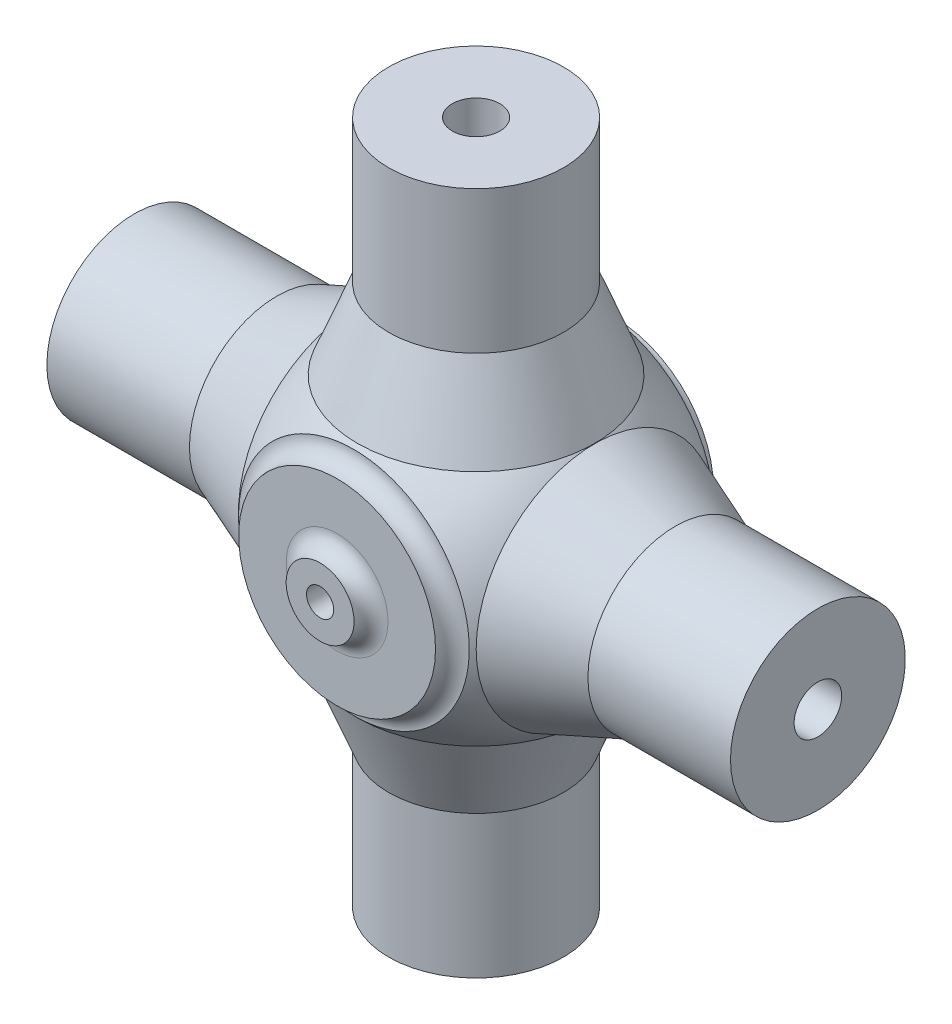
ISO-10303-21;
HEADER;
FILE_DESCRIPTION(('STEP AP214'),'2;1');
FILE_NAME('part.step','',(''),(''),'','','');
FILE_SCHEMA(('AUTOMOTIVE_DESIGN { 1 0 10303 214 1 1 1 1 }'));
ENDSEC;
DATA;
#1=APPLICATION_CONTEXT('core data for automotive mechanical design processes');
#2=APPLICATION_PROTOCOL_DEFINITION('international standard','automotive_design',2000,#1);
#3=PRODUCT_CONTEXT('',#1,'mechanical');
#4=PRODUCT('Part','Part','',(#3));
#5=PRODUCT_RELATED_PRODUCT_CATEGORY('part','',(#4));
#6=PRODUCT_DEFINITION_FORMATION('','',#4);
#7=PRODUCT_DEFINITION_CONTEXT('part definition',#1,'design');
#8=PRODUCT_DEFINITION('design','',#6,#7);
#9=PRODUCT_DEFINITION_SHAPE('','',#8);
#10=(LENGTH_UNIT() NAMED_UNIT(*) SI_UNIT(.MILLI.,.METRE.));
#11=(NAMED_UNIT(*) PLANE_ANGLE_UNIT() SI_UNIT($,.RADIAN.));
#12=(NAMED_UNIT(*) SI_UNIT($,.STERADIAN.) SOLID_ANGLE_UNIT());
#13=UNCERTAINTY_MEASURE_WITH_UNIT(LENGTH_MEASURE(1.E-05),#10,'distance_accuracy_value','');
#14=(GEOMETRIC_REPRESENTATION_CONTEXT(3) GLOBAL_UNCERTAINTY_ASSIGNED_CONTEXT((#13)) GLOBAL_UNIT_ASSIGNED_CONTEXT((#10,
#11,#12)) REPRESENTATION_CONTEXT('',''));
#15=CARTESIAN_POINT('',(0.,0.,0.));
#16=DIRECTION('',(0.,0.,1.));
#17=DIRECTION('',(1.,0.,0.));
#18=AXIS2_PLACEMENT_3D('',#15,#16,#17);
#19=CARTESIAN_POINT('',(0.,0.,40.95));
#20=DIRECTION('',(0.,0.,1.));
#21=DIRECTION('',(1.,0.,0.));
#22=AXIS2_PLACEMENT_3D('',#19,#20,#21);
#23=PLANE('',#22);
#24=CARTESIAN_POINT('',(0.,0.,40.95));
#25=DIRECTION('',(0.,0.,1.));
#26=DIRECTION('',(1.,0.,0.));
#27=AXIS2_PLACEMENT_3D('',#24,#25,#26);
#28=CIRCLE('',#27,15.);
#29=CARTESIAN_POINT('',(15.,0.,40.95));
#30=VERTEX_POINT('',#29);
#31=EDGE_CURVE('E42',#30,#30,#28,.F.);
#32=ORIENTED_EDGE('',*,*,#31,.T.);
#33=EDGE_LOOP('',(#32));
#34=FACE_BOUND('',#33,.T.);
#35=CARTESIAN_POINT('',(0.,0.,40.95));
#36=DIRECTION('',(0.,0.,1.));
#37=DIRECTION('',(1.,0.,0.));
#38=AXIS2_PLACEMENT_3D('',#35,#36,#37);
#39=CIRCLE('',#38,29.);
#40=CARTESIAN_POINT('',(29.,0.,40.95));
#41=VERTEX_POINT('',#40);
#42=EDGE_CURVE('E139',#41,#41,#39,.T.);
#43=ORIENTED_EDGE('',*,*,#42,.T.);
#44=EDGE_LOOP('',(#43));
#45=FACE_BOUND('',#44,.T.);
#46=ADVANCED_FACE('F34',(#34,#45),#23,.T.);
#47=CARTESIAN_POINT('',(0.,-100.7,0.));
#48=DIRECTION('',(0.,1.,0.));
#49=DIRECTION('',(0.,0.,1.));
#50=AXIS2_PLACEMENT_3D('',#47,#48,#49);
#51=CYLINDRICAL_SURFACE('',#50,7.);
#52=CARTESIAN_POINT('',(0.,100.7,0.));
#53=DIRECTION('',(0.,1.,0.));
#54=DIRECTION('',(0.,0.,1.));
#55=AXIS2_PLACEMENT_3D('',#52,#53,#54);
#56=CIRCLE('',#55,7.);
#57=CARTESIAN_POINT('',(0.,100.7,7.));
#58=VERTEX_POINT('',#57);
#59=EDGE_CURVE('E131',#58,#58,#56,.T.);
#60=ORIENTED_EDGE('',*,*,#59,.T.);
#61=EDGE_LOOP('',(#60));
#62=FACE_BOUND('',#61,.T.);
#63=CARTESIAN_POINT('',(0.,0.,0.));
#64=DIRECTION('',(0.707106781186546,0.707106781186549,0.));
#65=DIRECTION('',(-0.707106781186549,0.707106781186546,0.));
#66=AXIS2_PLACEMENT_3D('',#63,#64,#65);
#67=ELLIPSE('',#66,9.89949493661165,7.);
#68=CARTESIAN_POINT('',(-2.82842712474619,2.82842712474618,6.40312423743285));
#69=VERTEX_POINT('',#68);
#70=CARTESIAN_POINT('',(-2.8284271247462,2.82842712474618,-6.40312423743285));
#71=VERTEX_POINT('',#70);
#72=EDGE_CURVE('E96',#69,#71,#67,.F.);
#73=ORIENTED_EDGE('',*,*,#72,.T.);
#74=CARTESIAN_POINT('',(-3.9541044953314,-0.604199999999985,-5.7762494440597));
#75=CARTESIAN_POINT('',(-3.96866208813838,-0.509054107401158,-5.76626479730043));
#76=CARTESIAN_POINT('',(-3.97978637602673,-0.413132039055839,-5.75858720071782));
#77=CARTESIAN_POINT('',(-3.99508179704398,-0.220490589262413,-5.74799689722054));
#78=CARTESIAN_POINT('',(-3.99925403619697,-0.123771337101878,-5.745083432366));
#79=CARTESIAN_POINT('',(-4.00055954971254,0.0691562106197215,-5.74417166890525));
#80=CARTESIAN_POINT('',(-3.99773515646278,0.165364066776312,-5.74614381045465));
#81=CARTESIAN_POINT('',(-3.9851859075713,0.35710247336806,-5.75485489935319));
#82=CARTESIAN_POINT('',(-3.97546133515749,0.452633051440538,-5.76159365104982));
#83=CARTESIAN_POINT('',(-3.94925575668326,0.642291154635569,-5.77958735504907));
#84=CARTESIAN_POINT('',(-3.93277747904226,0.736419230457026,-5.79084048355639));
#85=CARTESIAN_POINT('',(-3.89328621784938,0.922715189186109,-5.81746374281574));
#86=CARTESIAN_POINT('',(-3.87027059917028,1.0148822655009,-5.83283553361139));
#87=CARTESIAN_POINT('',(-3.79176313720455,1.28775814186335,-5.88442741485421));
#88=CARTESIAN_POINT('',(-3.72681598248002,1.4648041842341,-5.92612014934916));
#89=CARTESIAN_POINT('',(-3.56992788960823,1.81508032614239,-6.02199883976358));
#90=CARTESIAN_POINT('',(-3.47670391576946,1.9875710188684,-6.07674374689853));
#91=CARTESIAN_POINT('',(-3.26719085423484,2.31590238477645,-6.19191075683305));
#92=CARTESIAN_POINT('',(-3.15088744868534,2.4717326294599,-6.25233637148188));
#93=CARTESIAN_POINT('',(-2.87555066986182,2.78974406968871,-6.38422220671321));
#94=CARTESIAN_POINT('',(-2.71261472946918,2.9485066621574,-6.45581307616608));
#95=CARTESIAN_POINT('',(-2.36038563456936,3.23733743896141,-6.59273731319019));
#96=CARTESIAN_POINT('',(-2.17108453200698,3.36739693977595,-6.65806878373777));
#97=CARTESIAN_POINT('',(-1.8686329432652,3.53864336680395,-6.74682062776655));
#98=CARTESIAN_POINT('',(-1.7636949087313,3.59212405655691,-6.77507616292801));
#99=CARTESIAN_POINT('',(-1.54866164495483,3.68992881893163,-6.82743441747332));
#100=CARTESIAN_POINT('',(-1.43856899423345,3.73425741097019,-6.8515391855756));
#101=CARTESIAN_POINT('',(-1.21409990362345,3.81314927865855,-6.89485480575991));
#102=CARTESIAN_POINT('',(-1.09972672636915,3.84771982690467,-6.91406930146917));
#103=CARTESIAN_POINT('',(-0.867601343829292,3.9066093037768,-6.94701363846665));
#104=CARTESIAN_POINT('',(-0.749849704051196,3.93092993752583,-6.96074439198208));
#105=CARTESIAN_POINT('',(-0.526670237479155,3.96658313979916,-6.98094519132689));
#106=CARTESIAN_POINT('',(-0.421498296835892,3.97914116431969,-6.98809828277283));
#107=CARTESIAN_POINT('',(-0.210279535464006,3.9958733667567,-6.99763933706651));
#108=CARTESIAN_POINT('',(-0.10423279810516,4.00004833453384,-7.00002774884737));
#109=CARTESIAN_POINT('',(0.107830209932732,3.99995085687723,-6.99997178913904));
#110=CARTESIAN_POINT('',(0.213846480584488,3.99568084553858,-6.99752881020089));
#111=CARTESIAN_POINT('',(0.424961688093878,3.97877362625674,-6.98788945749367));
#112=CARTESIAN_POINT('',(0.530060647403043,3.96613662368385,-6.98069320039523));
#113=CARTESIAN_POINT('',(0.827106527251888,3.91840813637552,-6.95364785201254));
#114=CARTESIAN_POINT('',(1.01705996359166,3.87336186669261,-6.9282437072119));
#115=CARTESIAN_POINT('',(1.38619986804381,3.75712581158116,-6.86394039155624));
#116=CARTESIAN_POINT('',(1.56538496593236,3.68593270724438,-6.82503950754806));
#117=CARTESIAN_POINT('',(1.91964515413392,3.51508715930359,-6.73426243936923));
#118=CARTESIAN_POINT('',(2.09387683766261,3.41402174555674,-6.68176378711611));
#119=CARTESIAN_POINT('',(2.42371937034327,3.18835090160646,-6.56932388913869));
#120=CARTESIAN_POINT('',(2.57931796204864,3.06373011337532,-6.50937779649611));
#121=CARTESIAN_POINT('',(2.888086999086,2.7764851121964,-6.37890650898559));
#122=CARTESIAN_POINT('',(3.03848485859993,2.61105152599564,-6.3079996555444));
#123=CARTESIAN_POINT('',(3.31045682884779,2.25628238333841,-6.1696178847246));
#124=CARTESIAN_POINT('',(3.43200873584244,2.06692858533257,-6.10214564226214));
#125=CARTESIAN_POINT('',(3.59257994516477,1.76277673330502,-6.0081182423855));
#126=CARTESIAN_POINT('',(3.64335848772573,1.6553470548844,-5.97736397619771));
#127=CARTESIAN_POINT('',(3.73547317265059,1.43542038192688,-5.92023424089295));
#128=CARTESIAN_POINT('',(3.77681480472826,1.32292637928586,-5.89385622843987));
#129=CARTESIAN_POINT('',(3.84939711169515,1.09386733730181,-5.8467098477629));
#130=CARTESIAN_POINT('',(3.88066046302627,0.977312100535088,-5.82592890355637));
#131=CARTESIAN_POINT('',(3.93264116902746,0.740918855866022,-5.79096903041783));
#132=CARTESIAN_POINT('',(3.95336286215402,0.621082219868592,-5.77678738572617));
#133=CARTESIAN_POINT('',(3.98008697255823,0.40909387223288,-5.7583935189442));
#134=CARTESIAN_POINT('',(3.98845434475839,0.317369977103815,-5.75258835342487));
#135=CARTESIAN_POINT('',(3.9988361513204,0.133396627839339,-5.74537627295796));
#136=CARTESIAN_POINT('',(4.00085164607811,0.0411472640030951,-5.74396862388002));
#137=CARTESIAN_POINT('',(3.99849002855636,-0.143777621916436,-5.74561504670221));
#138=CARTESIAN_POINT('',(3.99407463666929,-0.236452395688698,-5.7486958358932));
#139=CARTESIAN_POINT('',(3.9788597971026,-0.421055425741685,-5.75922823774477));
#140=CARTESIAN_POINT('',(3.96805844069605,-0.512983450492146,-5.766681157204));
#141=CARTESIAN_POINT('',(3.9541044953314,-0.604199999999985,-5.7762494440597));
#142=B_SPLINE_CURVE_WITH_KNOTS('',3,(#74,#75,#76,#77,#78,#79,#80,#81,#82,#83,#84,#85,#86,#87,
#88,#89,#90,#91,#92,#93,#94,#95,#96,#97,#98,#99,#100,#101,#102,#103,#104,#105,#106,#107,#108,
#109,#110,#111,#112,#113,#114,#115,#116,#117,#118,#119,#120,#121,#122,#123,#124,#125,#126,#127,
#128,#129,#130,#131,#132,#133,#134,#135,#136,#137,#138,#139,#140,#141),.UNSPECIFIED.,.F.,.F.,(4,
2,2,2,2,2,2,2,2,2,2,2,2,2,2,2,2,2,2,2,2,2,2,2,2,2,2,2,2,2,2,2,2,4),(0.,0.290232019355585,
0.580417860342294,0.868852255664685,1.15727481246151,1.44558096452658,1.73400349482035,
2.31096113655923,2.91950167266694,3.5284209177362,4.24078812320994,4.95337054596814,
5.31629910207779,5.67904800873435,6.04152584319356,6.4039433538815,6.7219966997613,
7.04002007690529,7.35795180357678,7.67587572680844,8.26361974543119,8.85143839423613,
9.47340356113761,10.0957756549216,10.7965121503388,11.4977862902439,11.8655601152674,
12.2331194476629,12.5998458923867,12.9664212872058,13.2429802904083,13.5194931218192,
13.7976586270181,14.0759073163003),.UNSPECIFIED.);
#143=CARTESIAN_POINT('',(2.82842712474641,2.82842712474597,-6.40312423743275));
#144=VERTEX_POINT('',#143);
#145=EDGE_CURVE('E49',#71,#144,#142,.T.);
#146=ORIENTED_EDGE('',*,*,#145,.T.);
#147=CARTESIAN_POINT('',(0.,0.,0.));
#148=DIRECTION('',(-0.707106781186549,0.707106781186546,0.));
#149=DIRECTION('',(0.707106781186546,0.707106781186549,0.));
#150=AXIS2_PLACEMENT_3D('',#147,#148,#149);
#151=ELLIPSE('',#150,9.89949493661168,7.);
#152=CARTESIAN_POINT('',(2.82842712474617,2.82842712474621,6.40312423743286));
#153=VERTEX_POINT('',#152);
#154=EDGE_CURVE('E94',#144,#153,#151,.F.);
#155=ORIENTED_EDGE('',*,*,#154,.T.);
#156=CARTESIAN_POINT('',(3.9541044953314,-0.604199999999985,5.7762494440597));
#157=CARTESIAN_POINT('',(3.96866208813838,-0.509054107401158,5.76626479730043));
#158=CARTESIAN_POINT('',(3.97978637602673,-0.413132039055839,5.75858720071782));
#159=CARTESIAN_POINT('',(3.99508179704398,-0.220490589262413,5.74799689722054));
#160=CARTESIAN_POINT('',(3.99925403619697,-0.123771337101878,5.745083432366));
#161=CARTESIAN_POINT('',(4.00055954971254,0.0691562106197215,5.74417166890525));
#162=CARTESIAN_POINT('',(3.99773515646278,0.165364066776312,5.74614381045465));
#163=CARTESIAN_POINT('',(3.9851859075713,0.35710247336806,5.75485489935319));
#164=CARTESIAN_POINT('',(3.97546133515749,0.452633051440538,5.76159365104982));
#165=CARTESIAN_POINT('',(3.94925575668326,0.642291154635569,5.77958735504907));
#166=CARTESIAN_POINT('',(3.93277747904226,0.736419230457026,5.79084048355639));
#167=CARTESIAN_POINT('',(3.89328621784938,0.922715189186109,5.81746374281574));
#168=CARTESIAN_POINT('',(3.87027059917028,1.0148822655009,5.83283553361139));
#169=CARTESIAN_POINT('',(3.79176313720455,1.28775814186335,5.88442741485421));
#170=CARTESIAN_POINT('',(3.72681598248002,1.4648041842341,5.92612014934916));
#171=CARTESIAN_POINT('',(3.56992788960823,1.81508032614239,6.02199883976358));
#172=CARTESIAN_POINT('',(3.47670391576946,1.9875710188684,6.07674374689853));
#173=CARTESIAN_POINT('',(3.26719085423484,2.31590238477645,6.19191075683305));
#174=CARTESIAN_POINT('',(3.15088744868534,2.4717326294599,6.25233637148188));
#175=CARTESIAN_POINT('',(2.87555066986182,2.78974406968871,6.38422220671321));
#176=CARTESIAN_POINT('',(2.71261472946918,2.9485066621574,6.45581307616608));
#177=CARTESIAN_POINT('',(2.36038563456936,3.23733743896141,6.59273731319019));
#178=CARTESIAN_POINT('',(2.17108453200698,3.36739693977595,6.65806878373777));
#179=CARTESIAN_POINT('',(1.8686329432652,3.53864336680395,6.74682062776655));
#180=CARTESIAN_POINT('',(1.7636949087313,3.59212405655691,6.77507616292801));
#181=CARTESIAN_POINT('',(1.54866164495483,3.68992881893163,6.82743441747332));
#182=CARTESIAN_POINT('',(1.43856899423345,3.73425741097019,6.8515391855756));
#183=CARTESIAN_POINT('',(1.21409990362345,3.81314927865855,6.89485480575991));
#184=CARTESIAN_POINT('',(1.09972672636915,3.84771982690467,6.91406930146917));
#185=CARTESIAN_POINT('',(0.867601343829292,3.9066093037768,6.94701363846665));
#186=CARTESIAN_POINT('',(0.749849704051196,3.93092993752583,6.96074439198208));
#187=CARTESIAN_POINT('',(0.526670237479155,3.96658313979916,6.98094519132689));
#188=CARTESIAN_POINT('',(0.421498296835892,3.97914116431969,6.98809828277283));
#189=CARTESIAN_POINT('',(0.210279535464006,3.9958733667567,6.99763933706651));
#190=CARTESIAN_POINT('',(0.10423279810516,4.00004833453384,7.00002774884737));
#191=CARTESIAN_POINT('',(-0.107830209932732,3.99995085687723,6.99997178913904));
#192=CARTESIAN_POINT('',(-0.213846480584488,3.99568084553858,6.99752881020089));
#193=CARTESIAN_POINT('',(-0.424961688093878,3.97877362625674,6.98788945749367));
#194=CARTESIAN_POINT('',(-0.530060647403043,3.96613662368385,6.98069320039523));
#195=CARTESIAN_POINT('',(-0.827106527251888,3.91840813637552,6.95364785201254));
#196=CARTESIAN_POINT('',(-1.01705996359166,3.87336186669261,6.9282437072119));
#197=CARTESIAN_POINT('',(-1.38619986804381,3.75712581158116,6.86394039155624));
#198=CARTESIAN_POINT('',(-1.56538496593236,3.68593270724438,6.82503950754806));
#199=CARTESIAN_POINT('',(-1.91964515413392,3.51508715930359,6.73426243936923));
#200=CARTESIAN_POINT('',(-2.09387683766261,3.41402174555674,6.68176378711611));
#201=CARTESIAN_POINT('',(-2.42371937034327,3.18835090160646,6.56932388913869));
#202=CARTESIAN_POINT('',(-2.57931796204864,3.06373011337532,6.50937779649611));
#203=CARTESIAN_POINT('',(-2.888086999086,2.7764851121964,6.37890650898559));
#204=CARTESIAN_POINT('',(-3.03848485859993,2.61105152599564,6.3079996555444));
#205=CARTESIAN_POINT('',(-3.31045682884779,2.25628238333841,6.1696178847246));
#206=CARTESIAN_POINT('',(-3.43200873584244,2.06692858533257,6.10214564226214));
#207=CARTESIAN_POINT('',(-3.59257994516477,1.76277673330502,6.0081182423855));
#208=CARTESIAN_POINT('',(-3.64335848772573,1.6553470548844,5.97736397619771));
#209=CARTESIAN_POINT('',(-3.73547317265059,1.43542038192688,5.92023424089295));
#210=CARTESIAN_POINT('',(-3.77681480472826,1.32292637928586,5.89385622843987));
#211=CARTESIAN_POINT('',(-3.84939711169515,1.09386733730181,5.8467098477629));
#212=CARTESIAN_POINT('',(-3.88066046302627,0.977312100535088,5.82592890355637));
#213=CARTESIAN_POINT('',(-3.93264116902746,0.740918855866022,5.79096903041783));
#214=CARTESIAN_POINT('',(-3.95336286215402,0.621082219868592,5.77678738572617));
#215=CARTESIAN_POINT('',(-3.98008697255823,0.40909387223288,5.7583935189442));
#216=CARTESIAN_POINT('',(-3.98845434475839,0.317369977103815,5.75258835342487));
#217=CARTESIAN_POINT('',(-3.9988361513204,0.133396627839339,5.74537627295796));
#218=CARTESIAN_POINT('',(-4.00085164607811,0.0411472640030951,5.74396862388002));
#219=CARTESIAN_POINT('',(-3.99849002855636,-0.143777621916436,5.74561504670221));
#220=CARTESIAN_POINT('',(-3.99407463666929,-0.236452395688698,5.7486958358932));
#221=CARTESIAN_POINT('',(-3.9788597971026,-0.421055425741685,5.75922823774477));
#222=CARTESIAN_POINT('',(-3.96805844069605,-0.512983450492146,5.766681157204));
#223=CARTESIAN_POINT('',(-3.9541044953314,-0.604199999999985,5.7762494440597));
#224=B_SPLINE_CURVE_WITH_KNOTS('',3,(#156,#157,#158,#159,#160,#161,#162,#163,#164,#165,#166,
#167,#168,#169,#170,#171,#172,#173,#174,#175,#176,#177,#178,#179,#180,#181,#182,#183,#184,#185,
#186,#187,#188,#189,#190,#191,#192,#193,#194,#195,#196,#197,#198,#199,#200,#201,#202,#203,#204,
#205,#206,#207,#208,#209,#210,#211,#212,#213,#214,#215,#216,#217,#218,#219,#220,#221,#222,#223),
.UNSPECIFIED.,.F.,.F.,(4,2,2,2,2,2,2,2,2,2,2,2,2,2,2,2,2,2,2,2,2,2,2,2,2,2,2,2,2,2,2,2,2,4),(0.,
0.290232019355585,0.580417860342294,0.868852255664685,1.15727481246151,1.44558096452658,
1.73400349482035,2.31096113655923,2.91950167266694,3.5284209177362,4.24078812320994,
4.95337054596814,5.31629910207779,5.67904800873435,6.04152584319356,6.4039433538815,
6.7219966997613,7.04002007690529,7.35795180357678,7.67587572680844,8.26361974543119,
8.85143839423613,9.47340356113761,10.0957756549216,10.7965121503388,11.4977862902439,
11.8655601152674,12.2331194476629,12.5998458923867,12.9664212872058,13.2429802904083,
13.5194931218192,13.7976586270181,14.0759073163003),.UNSPECIFIED.);
#225=EDGE_CURVE('E478',#153,#69,#224,.T.);
#226=ORIENTED_EDGE('',*,*,#225,.T.);
#227=EDGE_LOOP('',(#73,#146,#155,#226));
#228=FACE_BOUND('',#227,.T.);
#229=ADVANCED_FACE('F205',(#62,#228),#51,.F.);
#230=CARTESIAN_POINT('',(-115.7,-55.,36.));
#231=DIRECTION('',(0.,0.,1.));
#232=DIRECTION('',(1.,0.,0.));
#233=AXIS2_PLACEMENT_3D('',#230,#231,#232);
#234=PLANE('',#233);
#235=CARTESIAN_POINT('',(0.,0.,36.));
#236=DIRECTION('',(0.,0.,1.));
#237=DIRECTION('',(1.,0.,0.));
#238=AXIS2_PLACEMENT_3D('',#235,#236,#237);
#239=CIRCLE('',#238,33.9699597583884);
#240=CARTESIAN_POINT('',(33.9699597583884,0.,36.));
#241=VERTEX_POINT('',#240);
#242=EDGE_CURVE('E182',#241,#241,#239,.F.);
#243=ORIENTED_EDGE('',*,*,#242,.T.);
#244=EDGE_LOOP('',(#243));
#245=FACE_BOUND('',#244,.T.);
#246=CARTESIAN_POINT('',(0.,0.,36.));
#247=DIRECTION('',(0.,0.,1.));
#248=DIRECTION('',(1.,0.,0.));
#249=AXIS2_PLACEMENT_3D('',#246,#247,#248);
#250=CIRCLE('',#249,33.9742549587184);
#251=CARTESIAN_POINT('',(33.9742549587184,0.,36.));
#252=VERTEX_POINT('',#251);
#253=EDGE_CURVE('E142',#252,#252,#250,.T.);
#254=ORIENTED_EDGE('',*,*,#253,.T.);
#255=EDGE_LOOP('',(#254));
#256=FACE_BOUND('',#255,.T.);
#257=ADVANCED_FACE('F214',(#245,#256),#234,.T.);
#258=CARTESIAN_POINT('',(-115.7,-55.,-36.));
#259=DIRECTION('',(0.,0.,-1.));
#260=DIRECTION('',(-1.,0.,0.));
#261=AXIS2_PLACEMENT_3D('',#258,#259,#260);
#262=PLANE('',#261);
#263=CARTESIAN_POINT('',(0.,0.,-36.));
#264=DIRECTION('',(0.,0.,-1.));
#265=DIRECTION('',(-1.,0.,0.));
#266=AXIS2_PLACEMENT_3D('',#263,#264,#265);
#267=CIRCLE('',#266,33.9699597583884);
#268=CARTESIAN_POINT('',(-33.9699597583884,0.,-36.));
#269=VERTEX_POINT('',#268);
#270=EDGE_CURVE('E99',#269,#269,#267,.F.);
#271=ORIENTED_EDGE('',*,*,#270,.T.);
#272=EDGE_LOOP('',(#271));
#273=FACE_BOUND('',#272,.T.);
#274=CARTESIAN_POINT('',(0.,0.,-36.));
#275=DIRECTION('',(0.,0.,-1.));
#276=DIRECTION('',(-1.,0.,0.));
#277=AXIS2_PLACEMENT_3D('',#274,#275,#276);
#278=CIRCLE('',#277,33.9742549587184);
#279=CARTESIAN_POINT('',(-33.9742549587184,0.,-36.));
#280=VERTEX_POINT('',#279);
#281=EDGE_CURVE('E149',#280,#280,#278,.T.);
#282=ORIENTED_EDGE('',*,*,#281,.T.);
#283=EDGE_LOOP('',(#282));
#284=FACE_BOUND('',#283,.T.);
#285=ADVANCED_FACE('F191',(#273,#284),#262,.T.);
#286=CARTESIAN_POINT('',(0.,0.,0.));
#287=DIRECTION('',(0.,1.,0.));
#288=DIRECTION('',(1.,0.,0.));
#289=AXIS2_PLACEMENT_3D('',#286,#287,#288);
#290=SPHERICAL_SURFACE('',#289,49.5);
#291=ORIENTED_EDGE('',*,*,#253,.F.);
#292=EDGE_LOOP('',(#291));
#293=FACE_BOUND('',#292,.T.);
#294=CARTESIAN_POINT('',(-35.0140308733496,-1.22250835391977E-13,0.));
#295=DIRECTION('',(1.,0.,0.));
#296=DIRECTION('',(0.,1.,0.));
#297=AXIS2_PLACEMENT_3D('',#294,#295,#296);
#298=CIRCLE('',#297,34.9895361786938);
#299=CARTESIAN_POINT('',(-35.0140308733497,34.9895361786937,0.));
#300=VERTEX_POINT('',#299);
#301=EDGE_CURVE('E176',#300,#300,#298,.F.);
#302=ORIENTED_EDGE('',*,*,#301,.F.);
#303=EDGE_LOOP('',(#302));
#304=FACE_BOUND('',#303,.T.);
#305=CARTESIAN_POINT('',(0.,35.0140308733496,0.));
#306=DIRECTION('',(0.,1.,0.));
#307=DIRECTION('',(0.,0.,1.));
#308=AXIS2_PLACEMENT_3D('',#305,#306,#307);
#309=CIRCLE('',#308,34.9895361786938);
#310=CARTESIAN_POINT('',(0.,35.0140308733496,34.9895361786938));
#311=VERTEX_POINT('',#310);
#312=EDGE_CURVE('E164',#311,#311,#309,.T.);
#313=ORIENTED_EDGE('',*,*,#312,.F.);
#314=EDGE_LOOP('',(#313));
#315=FACE_BOUND('',#314,.T.);
#316=CARTESIAN_POINT('',(0.,-35.0140308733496,0.));
#317=DIRECTION('',(0.,1.,0.));
#318=DIRECTION('',(0.,0.,1.));
#319=AXIS2_PLACEMENT_3D('',#316,#317,#318);
#320=CIRCLE('',#319,34.9895361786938);
#321=CARTESIAN_POINT('',(0.,-35.0140308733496,34.9895361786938));
#322=VERTEX_POINT('',#321);
#323=EDGE_CURVE('E167',#322,#322,#320,.T.);
#324=ORIENTED_EDGE('',*,*,#323,.T.);
#325=EDGE_LOOP('',(#324));
#326=FACE_BOUND('',#325,.T.);
#327=CARTESIAN_POINT('',(35.0140308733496,1.22250835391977E-13,0.));
#328=DIRECTION('',(-1.,0.,0.));
#329=DIRECTION('',(0.,-1.,0.));
#330=AXIS2_PLACEMENT_3D('',#327,#328,#329);
#331=CIRCLE('',#330,34.9895361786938);
#332=CARTESIAN_POINT('',(35.0140308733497,-34.9895361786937,0.));
#333=VERTEX_POINT('',#332);
#334=EDGE_CURVE('E179',#333,#333,#331,.F.);
#335=ORIENTED_EDGE('',*,*,#334,.F.);
#336=EDGE_LOOP('',(#335));
#337=FACE_BOUND('',#336,.T.);
#338=ORIENTED_EDGE('',*,*,#281,.F.);
#339=EDGE_LOOP('',(#338));
#340=FACE_BOUND('',#339,.T.);
#341=ADVANCED_FACE('F225',(#293,#304,#315,#326,#337,#340),#290,.T.);
#342=CARTESIAN_POINT('',(0.,-100.7,0.));
#343=DIRECTION('',(0.,1.,0.));
#344=DIRECTION('',(0.,0.,1.));
#345=AXIS2_PLACEMENT_3D('',#342,#343,#344);
#346=PLANE('',#345);
#347=CARTESIAN_POINT('',(0.,-100.7,0.));
#348=DIRECTION('',(0.,1.,0.));
#349=DIRECTION('',(0.,0.,1.));
#350=AXIS2_PLACEMENT_3D('',#347,#348,#349);
#351=CIRCLE('',#350,7.);
#352=CARTESIAN_POINT('',(0.,-100.7,7.));
#353=VERTEX_POINT('',#352);
#354=EDGE_CURVE('E133',#353,#353,#351,.T.);
#355=ORIENTED_EDGE('',*,*,#354,.T.);
#356=EDGE_LOOP('',(#355));
#357=FACE_BOUND('',#356,.T.);
#358=CARTESIAN_POINT('',(0.,-100.7,0.));
#359=DIRECTION('',(0.,1.,0.));
#360=DIRECTION('',(0.,0.,1.));
#361=AXIS2_PLACEMENT_3D('',#358,#359,#360);
#362=CIRCLE('',#361,25.75);
#363=CARTESIAN_POINT('',(0.,-100.7,25.75));
#364=VERTEX_POINT('',#363);
#365=EDGE_CURVE('E173',#364,#364,#362,.T.);
#366=ORIENTED_EDGE('',*,*,#365,.F.);
#367=EDGE_LOOP('',(#366));
#368=FACE_BOUND('',#367,.T.);
#369=ADVANCED_FACE('F267',(#357,#368),#346,.F.);
#370=CARTESIAN_POINT('',(0.,178.069393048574,0.));
#371=DIRECTION('',(0.,1.,0.));
#372=DIRECTION('',(0.,0.,1.));
#373=AXIS2_PLACEMENT_3D('',#370,#371,#372);
#374=CYLINDRICAL_SURFACE('',#373,25.75);
#375=CARTESIAN_POINT('',(0.,-58.7,0.));
#376=DIRECTION('',(0.,1.,0.));
#377=DIRECTION('',(0.,0.,1.));
#378=AXIS2_PLACEMENT_3D('',#375,#376,#377);
#379=CIRCLE('',#378,25.75);
#380=CARTESIAN_POINT('',(0.,-58.7,25.75));
#381=VERTEX_POINT('',#380);
#382=EDGE_CURVE('E170',#381,#381,#379,.T.);
#383=ORIENTED_EDGE('',*,*,#382,.F.);
#384=EDGE_LOOP('',(#383));
#385=FACE_BOUND('',#384,.T.);
#386=ORIENTED_EDGE('',*,*,#365,.T.);
#387=EDGE_LOOP('',(#386));
#388=FACE_BOUND('',#387,.T.);
#389=ADVANCED_FACE('F271',(#385,#388),#374,.T.);
#390=CARTESIAN_POINT('',(0.,-58.7,0.));
#391=DIRECTION('',(0.,1.,0.));
#392=DIRECTION('',(0.,0.,1.));
#393=AXIS2_PLACEMENT_3D('',#390,#391,#392);
#394=CONICAL_SURFACE('',#393,25.75,0.371929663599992);
#395=ORIENTED_EDGE('',*,*,#323,.F.);
#396=EDGE_LOOP('',(#395));
#397=FACE_BOUND('',#396,.T.);
#398=ORIENTED_EDGE('',*,*,#382,.T.);
#399=EDGE_LOOP('',(#398));
#400=FACE_BOUND('',#399,.T.);
#401=ADVANCED_FACE('F263',(#397,#400),#394,.T.);
#402=CARTESIAN_POINT('',(0.,35.0140308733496,0.));
#403=DIRECTION('',(0.,-1.,0.));
#404=DIRECTION('',(0.,0.,-1.));
#405=AXIS2_PLACEMENT_3D('',#402,#403,#404);
#406=CONICAL_SURFACE('',#405,34.9895361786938,0.371929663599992);
#407=CARTESIAN_POINT('',(0.,58.7,0.));
#408=DIRECTION('',(0.,1.,0.));
#409=DIRECTION('',(0.,0.,1.));
#410=AXIS2_PLACEMENT_3D('',#407,#408,#409);
#411=CIRCLE('',#410,25.75);
#412=CARTESIAN_POINT('',(0.,58.7,25.75));
#413=VERTEX_POINT('',#412);
#414=EDGE_CURVE('E161',#413,#413,#411,.T.);
#415=ORIENTED_EDGE('',*,*,#414,.F.);
#416=EDGE_LOOP('',(#415));
#417=FACE_BOUND('',#416,.T.);
#418=ORIENTED_EDGE('',*,*,#312,.T.);
#419=EDGE_LOOP('',(#418));
#420=FACE_BOUND('',#419,.T.);
#421=ADVANCED_FACE('F259',(#417,#420),#406,.T.);
#422=CARTESIAN_POINT('',(0.,178.069393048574,0.));
#423=DIRECTION('',(0.,1.,0.));
#424=DIRECTION('',(0.,0.,1.));
#425=AXIS2_PLACEMENT_3D('',#422,#423,#424);
#426=CYLINDRICAL_SURFACE('',#425,25.75);
#427=CARTESIAN_POINT('',(0.,100.7,0.));
#428=DIRECTION('',(0.,1.,0.));
#429=DIRECTION('',(0.,0.,1.));
#430=AXIS2_PLACEMENT_3D('',#427,#428,#429);
#431=CIRCLE('',#430,25.75);
#432=CARTESIAN_POINT('',(0.,100.7,25.75));
#433=VERTEX_POINT('',#432);
#434=EDGE_CURVE('E158',#433,#433,#431,.T.);
#435=ORIENTED_EDGE('',*,*,#434,.F.);
#436=EDGE_LOOP('',(#435));
#437=FACE_BOUND('',#436,.T.);
#438=ORIENTED_EDGE('',*,*,#414,.T.);
#439=EDGE_LOOP('',(#438));
#440=FACE_BOUND('',#439,.T.);
#441=ADVANCED_FACE('F255',(#437,#440),#426,.T.);
#442=CARTESIAN_POINT('',(0.,100.7,0.));
#443=DIRECTION('',(0.,-1.,0.));
#444=DIRECTION('',(0.,0.,-1.));
#445=AXIS2_PLACEMENT_3D('',#442,#443,#444);
#446=PLANE('',#445);
#447=ORIENTED_EDGE('',*,*,#59,.F.);
#448=EDGE_LOOP('',(#447));
#449=FACE_BOUND('',#448,.T.);
#450=ORIENTED_EDGE('',*,*,#434,.T.);
#451=EDGE_LOOP('',(#450));
#452=FACE_BOUND('',#451,.T.);
#453=ADVANCED_FACE('F233',(#449,#452),#446,.F.);
#454=CARTESIAN_POINT('',(-100.7,-3.88061947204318E-13,0.));
#455=DIRECTION('',(1.,0.,0.));
#456=DIRECTION('',(0.,0.,-1.));
#457=AXIS2_PLACEMENT_3D('',#454,#455,#456);
#458=PLANE('',#457);
#459=CARTESIAN_POINT('',(-100.7,-3.51686404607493E-13,0.));
#460=DIRECTION('',(1.,0.,0.));
#461=DIRECTION('',(0.,1.,0.));
#462=AXIS2_PLACEMENT_3D('',#459,#460,#461);
#463=CIRCLE('',#462,7.);
#464=CARTESIAN_POINT('',(-100.7,6.99999999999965,0.));
#465=VERTEX_POINT('',#464);
#466=EDGE_CURVE('E123',#465,#465,#463,.T.);
#467=ORIENTED_EDGE('',*,*,#466,.T.);
#468=EDGE_LOOP('',(#467));
#469=FACE_BOUND('',#468,.T.);
#470=CARTESIAN_POINT('',(-100.7,-3.51592170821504E-13,0.));
#471=DIRECTION('',(-1.,0.,0.));
#472=DIRECTION('',(0.,0.,1.));
#473=AXIS2_PLACEMENT_3D('',#470,#471,#472);
#474=CIRCLE('',#473,25.75);
#475=CARTESIAN_POINT('',(-100.7,-3.51592170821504E-13,25.75));
#476=VERTEX_POINT('',#475);
#477=EDGE_CURVE('E145',#476,#476,#474,.T.);
#478=ORIENTED_EDGE('',*,*,#477,.T.);
#479=EDGE_LOOP('',(#478));
#480=FACE_BOUND('',#479,.T.);
#481=ADVANCED_FACE('F229',(#469,#480),#458,.F.);
#482=CARTESIAN_POINT('',(-178.069393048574,-6.21725962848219E-13,0.));
#483=DIRECTION('',(-1.,0.,0.));
#484=DIRECTION('',(0.,0.,1.));
#485=AXIS2_PLACEMENT_3D('',#482,#483,#484);
#486=CYLINDRICAL_SURFACE('',#485,25.75);
#487=ORIENTED_EDGE('',*,*,#477,.F.);
#488=EDGE_LOOP('',(#487));
#489=FACE_BOUND('',#488,.T.);
#490=CARTESIAN_POINT('',(-58.7,-2.04949954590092E-13,0.));
#491=DIRECTION('',(-1.,0.,0.));
#492=DIRECTION('',(0.,0.,1.));
#493=AXIS2_PLACEMENT_3D('',#490,#491,#492);
#494=CIRCLE('',#493,25.75);
#495=CARTESIAN_POINT('',(-58.7,-2.04949954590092E-13,25.75));
#496=VERTEX_POINT('',#495);
#497=EDGE_CURVE('E148',#496,#496,#494,.T.);
#498=ORIENTED_EDGE('',*,*,#497,.T.);
#499=EDGE_LOOP('',(#498));
#500=FACE_BOUND('',#499,.T.);
#501=ADVANCED_FACE('F232',(#489,#500),#486,.T.);
#502=CARTESIAN_POINT('',(-35.0140308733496,-1.22250835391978E-13,0.));
#503=DIRECTION('',(1.,0.,0.));
#504=DIRECTION('',(0.,0.,-1.));
#505=AXIS2_PLACEMENT_3D('',#502,#503,#504);
#506=CONICAL_SURFACE('',#505,34.9895361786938,0.371929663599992);
#507=ORIENTED_EDGE('',*,*,#497,.F.);
#508=EDGE_LOOP('',(#507));
#509=FACE_BOUND('',#508,.T.);
#510=ORIENTED_EDGE('',*,*,#301,.T.);
#511=EDGE_LOOP('',(#510));
#512=FACE_BOUND('',#511,.T.);
#513=ADVANCED_FACE('F237',(#509,#512),#506,.T.);
#514=CARTESIAN_POINT('',(100.7,3.76781324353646E-13,0.));
#515=DIRECTION('',(-1.,0.,0.));
#516=DIRECTION('',(0.,0.,1.));
#517=AXIS2_PLACEMENT_3D('',#514,#515,#516);
#518=PLANE('',#517);
#519=CARTESIAN_POINT('',(100.699999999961,3.51498344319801E-13,0.));
#520=DIRECTION('',(1.,0.,0.));
#521=DIRECTION('',(0.,1.,0.));
#522=AXIS2_PLACEMENT_3D('',#519,#520,#521);
#523=CIRCLE('',#522,7.);
#524=CARTESIAN_POINT('',(100.699999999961,7.00000000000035,0.));
#525=VERTEX_POINT('',#524);
#526=EDGE_CURVE('E119',#525,#525,#523,.T.);
#527=ORIENTED_EDGE('',*,*,#526,.F.);
#528=EDGE_LOOP('',(#527));
#529=FACE_BOUND('',#528,.T.);
#530=CARTESIAN_POINT('',(100.7,3.51592170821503E-13,0.));
#531=DIRECTION('',(-1.,0.,0.));
#532=DIRECTION('',(0.,0.,1.));
#533=AXIS2_PLACEMENT_3D('',#530,#531,#532);
#534=CIRCLE('',#533,25.75);
#535=CARTESIAN_POINT('',(100.7,3.51592170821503E-13,25.75));
#536=VERTEX_POINT('',#535);
#537=EDGE_CURVE('E155',#536,#536,#534,.T.);
#538=ORIENTED_EDGE('',*,*,#537,.F.);
#539=EDGE_LOOP('',(#538));
#540=FACE_BOUND('',#539,.T.);
#541=ADVANCED_FACE('F241',(#529,#540),#518,.F.);
#542=CARTESIAN_POINT('',(-178.069393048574,-6.21725962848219E-13,0.));
#543=DIRECTION('',(-1.,0.,0.));
#544=DIRECTION('',(0.,0.,1.));
#545=AXIS2_PLACEMENT_3D('',#542,#543,#544);
#546=CYLINDRICAL_SURFACE('',#545,25.75);
#547=CARTESIAN_POINT('',(58.7,2.04949954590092E-13,0.));
#548=DIRECTION('',(-1.,0.,0.));
#549=DIRECTION('',(0.,0.,1.));
#550=AXIS2_PLACEMENT_3D('',#547,#548,#549);
#551=CIRCLE('',#550,25.75);
#552=CARTESIAN_POINT('',(58.7,2.04949954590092E-13,25.75));
#553=VERTEX_POINT('',#552);
#554=EDGE_CURVE('E152',#553,#553,#551,.T.);
#555=ORIENTED_EDGE('',*,*,#554,.F.);
#556=EDGE_LOOP('',(#555));
#557=FACE_BOUND('',#556,.T.);
#558=ORIENTED_EDGE('',*,*,#537,.T.);
#559=EDGE_LOOP('',(#558));
#560=FACE_BOUND('',#559,.T.);
#561=ADVANCED_FACE('F245',(#557,#560),#546,.T.);
#562=CARTESIAN_POINT('',(58.7,2.04949954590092E-13,0.));
#563=DIRECTION('',(-1.,0.,0.));
#564=DIRECTION('',(0.,0.,1.));
#565=AXIS2_PLACEMENT_3D('',#562,#563,#564);
#566=CONICAL_SURFACE('',#565,25.75,0.371929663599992);
#567=ORIENTED_EDGE('',*,*,#334,.T.);
#568=EDGE_LOOP('',(#567));
#569=FACE_BOUND('',#568,.T.);
#570=ORIENTED_EDGE('',*,*,#554,.T.);
#571=EDGE_LOOP('',(#570));
#572=FACE_BOUND('',#571,.T.);
#573=ADVANCED_FACE('F221',(#569,#572),#566,.T.);
#574=CARTESIAN_POINT('',(0.,0.,-40.95));
#575=DIRECTION('',(0.,0.,1.));
#576=DIRECTION('',(1.,0.,0.));
#577=AXIS2_PLACEMENT_3D('',#574,#575,#576);
#578=PLANE('',#577);
#579=CARTESIAN_POINT('',(0.,0.,-40.95));
#580=DIRECTION('',(0.,0.,1.));
#581=DIRECTION('',(1.,0.,0.));
#582=AXIS2_PLACEMENT_3D('',#579,#580,#581);
#583=CIRCLE('',#582,15.);
#584=CARTESIAN_POINT('',(15.,0.,-40.95));
#585=VERTEX_POINT('',#584);
#586=EDGE_CURVE('E11',#585,#585,#583,.T.);
#587=ORIENTED_EDGE('',*,*,#586,.T.);
#588=EDGE_LOOP('',(#587));
#589=FACE_BOUND('',#588,.T.);
#590=CARTESIAN_POINT('',(0.,0.,-40.95));
#591=DIRECTION('',(0.,0.,1.));
#592=DIRECTION('',(1.,0.,0.));
#593=AXIS2_PLACEMENT_3D('',#590,#591,#592);
#594=CIRCLE('',#593,29.);
#595=CARTESIAN_POINT('',(29.,0.,-40.95));
#596=VERTEX_POINT('',#595);
#597=EDGE_CURVE('E136',#596,#596,#594,.T.);
#598=ORIENTED_EDGE('',*,*,#597,.F.);
#599=EDGE_LOOP('',(#598));
#600=FACE_BOUND('',#599,.T.);
#601=ADVANCED_FACE('F206',(#589,#600),#578,.F.);
#602=CARTESIAN_POINT('',(0.,0.,40.97));
#603=DIRECTION('',(0.,0.,1.));
#604=DIRECTION('',(1.,0.,0.));
#605=AXIS2_PLACEMENT_3D('',#602,#603,#604);
#606=TOROIDAL_SURFACE('',#605,33.9699597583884,4.97);
#607=ORIENTED_EDGE('',*,*,#42,.F.);
#608=EDGE_LOOP('',(#607));
#609=FACE_BOUND('',#608,.T.);
#610=ORIENTED_EDGE('',*,*,#242,.F.);
#611=EDGE_LOOP('',(#610));
#612=FACE_BOUND('',#611,.T.);
#613=ADVANCED_FACE('F196',(#609,#612),#606,.F.);
#614=CARTESIAN_POINT('',(0.,0.,-40.97));
#615=DIRECTION('',(0.,0.,-1.));
#616=DIRECTION('',(-1.,0.,0.));
#617=AXIS2_PLACEMENT_3D('',#614,#615,#616);
#618=TOROIDAL_SURFACE('',#617,33.9699597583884,4.97);
#619=ORIENTED_EDGE('',*,*,#597,.T.);
#620=EDGE_LOOP('',(#619));
#621=FACE_BOUND('',#620,.T.);
#622=ORIENTED_EDGE('',*,*,#270,.F.);
#623=EDGE_LOOP('',(#622));
#624=FACE_BOUND('',#623,.T.);
#625=ADVANCED_FACE('F194',(#621,#624),#618,.F.);
#626=CARTESIAN_POINT('',(0.,0.,0.));
#627=DIRECTION('',(-0.707106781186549,0.707106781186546,0.));
#628=DIRECTION('',(0.707106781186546,0.707106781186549,0.));
#629=AXIS2_PLACEMENT_3D('',#626,#627,#628);
#630=ELLIPSE('',#629,9.89949493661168,7.);
#631=CARTESIAN_POINT('',(-2.8284271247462,-2.82842712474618,-6.40312423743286));
#632=VERTEX_POINT('',#631);
#633=CARTESIAN_POINT('',(-2.82842712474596,-2.82842712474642,6.40312423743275));
#634=VERTEX_POINT('',#633);
#635=EDGE_CURVE('E88',#632,#634,#630,.T.);
#636=ORIENTED_EDGE('',*,*,#635,.T.);
#637=CARTESIAN_POINT('',(-3.9541044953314,0.604200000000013,5.7762494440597));
#638=CARTESIAN_POINT('',(-3.96866208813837,0.509054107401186,5.76626479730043));
#639=CARTESIAN_POINT('',(-3.97978637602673,0.413132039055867,5.75858720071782));
#640=CARTESIAN_POINT('',(-3.99508179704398,0.220490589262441,5.74799689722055));
#641=CARTESIAN_POINT('',(-3.99925403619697,0.123771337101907,5.745083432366));
#642=CARTESIAN_POINT('',(-4.00055954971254,-0.0691562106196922,5.74417166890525));
#643=CARTESIAN_POINT('',(-3.99773515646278,-0.165364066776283,5.74614381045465));
#644=CARTESIAN_POINT('',(-3.9851859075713,-0.357102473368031,5.75485489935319));
#645=CARTESIAN_POINT('',(-3.9754613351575,-0.452633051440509,5.76159365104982));
#646=CARTESIAN_POINT('',(-3.94925575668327,-0.64229115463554,5.77958735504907));
#647=CARTESIAN_POINT('',(-3.93277747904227,-0.736419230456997,5.79084048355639));
#648=CARTESIAN_POINT('',(-3.89328621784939,-0.922715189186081,5.81746374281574));
#649=CARTESIAN_POINT('',(-3.87027059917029,-1.01488226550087,5.83283553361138));
#650=CARTESIAN_POINT('',(-3.79176313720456,-1.28775814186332,5.88442741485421));
#651=CARTESIAN_POINT('',(-3.72681598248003,-1.46480418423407,5.92612014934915));
#652=CARTESIAN_POINT('',(-3.56992788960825,-1.81508032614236,6.02199883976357));
#653=CARTESIAN_POINT('',(-3.47670391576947,-1.98757101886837,6.07674374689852));
#654=CARTESIAN_POINT('',(-3.26719085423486,-2.31590238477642,6.19191075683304));
#655=CARTESIAN_POINT('',(-3.15088744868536,-2.47173262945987,6.25233637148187));
#656=CARTESIAN_POINT('',(-2.87555066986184,-2.78974406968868,6.3842222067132));
#657=CARTESIAN_POINT('',(-2.7126147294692,-2.94850666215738,6.45581307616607));
#658=CARTESIAN_POINT('',(-2.36038563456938,-3.23733743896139,6.59273731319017));
#659=CARTESIAN_POINT('',(-2.17108453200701,-3.36739693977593,6.65806878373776));
#660=CARTESIAN_POINT('',(-1.86863294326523,-3.53864336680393,6.74682062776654));
#661=CARTESIAN_POINT('',(-1.76369490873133,-3.5921240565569,6.775076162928));
#662=CARTESIAN_POINT('',(-1.54866164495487,-3.68992881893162,6.82743441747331));
#663=CARTESIAN_POINT('',(-1.43856899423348,-3.73425741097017,6.85153918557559));
#664=CARTESIAN_POINT('',(-1.21409990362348,-3.81314927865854,6.89485480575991));
#665=CARTESIAN_POINT('',(-1.09972672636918,-3.84771982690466,6.91406930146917));
#666=CARTESIAN_POINT('',(-0.867601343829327,-3.90660930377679,6.94701363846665));
#667=CARTESIAN_POINT('',(-0.749849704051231,-3.93092993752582,6.96074439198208));
#668=CARTESIAN_POINT('',(-0.526670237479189,-3.96658313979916,6.98094519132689));
#669=CARTESIAN_POINT('',(-0.421498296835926,-3.97914116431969,6.98809828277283));
#670=CARTESIAN_POINT('',(-0.21027953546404,-3.9958733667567,6.99763933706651));
#671=CARTESIAN_POINT('',(-0.104232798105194,-4.00004833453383,7.00002774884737));
#672=CARTESIAN_POINT('',(0.107830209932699,-3.99995085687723,6.99997178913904));
#673=CARTESIAN_POINT('',(0.213846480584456,-3.99568084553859,6.99752881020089));
#674=CARTESIAN_POINT('',(0.424961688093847,-3.97877362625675,6.98788945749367));
#675=CARTESIAN_POINT('',(0.530060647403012,-3.96613662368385,6.98069320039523));
#676=CARTESIAN_POINT('',(0.827106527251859,-3.91840813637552,6.95364785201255));
#677=CARTESIAN_POINT('',(1.01705996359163,-3.87336186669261,6.92824370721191));
#678=CARTESIAN_POINT('',(1.38619986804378,-3.75712581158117,6.86394039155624));
#679=CARTESIAN_POINT('',(1.56538496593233,-3.68593270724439,6.82503950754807));
#680=CARTESIAN_POINT('',(1.9196451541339,-3.5150871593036,6.73426243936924));
#681=CARTESIAN_POINT('',(2.09387683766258,-3.41402174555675,6.68176378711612));
#682=CARTESIAN_POINT('',(2.42371937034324,-3.18835090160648,6.56932388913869));
#683=CARTESIAN_POINT('',(2.57931796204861,-3.06373011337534,6.50937779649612));
#684=CARTESIAN_POINT('',(2.88808699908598,-2.77648511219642,6.3789065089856));
#685=CARTESIAN_POINT('',(3.03848485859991,-2.61105152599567,6.30799965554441));
#686=CARTESIAN_POINT('',(3.31045682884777,-2.25628238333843,6.16961788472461));
#687=CARTESIAN_POINT('',(3.43200873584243,-2.0669285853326,6.10214564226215));
#688=CARTESIAN_POINT('',(3.59257994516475,-1.76277673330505,6.00811824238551));
#689=CARTESIAN_POINT('',(3.64335848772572,-1.65534705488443,5.97736397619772));
#690=CARTESIAN_POINT('',(3.73547317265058,-1.43542038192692,5.92023424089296));
#691=CARTESIAN_POINT('',(3.77681480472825,-1.32292637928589,5.89385622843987));
#692=CARTESIAN_POINT('',(3.84939711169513,-1.09386733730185,5.84670984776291));
#693=CARTESIAN_POINT('',(3.88066046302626,-0.977312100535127,5.82592890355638));
#694=CARTESIAN_POINT('',(3.93264116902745,-0.740918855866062,5.79096903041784));
#695=CARTESIAN_POINT('',(3.95336286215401,-0.621082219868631,5.77678738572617));
#696=CARTESIAN_POINT('',(3.98008697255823,-0.409093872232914,5.75839351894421));
#697=CARTESIAN_POINT('',(3.98845434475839,-0.317369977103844,5.75258835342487));
#698=CARTESIAN_POINT('',(3.9988361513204,-0.133396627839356,5.74537627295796));
#699=CARTESIAN_POINT('',(4.00085164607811,-0.0411472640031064,5.74396862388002));
#700=CARTESIAN_POINT('',(3.99849002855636,0.143777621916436,5.74561504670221));
#701=CARTESIAN_POINT('',(3.99407463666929,0.236452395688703,5.7486958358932));
#702=CARTESIAN_POINT('',(3.9788597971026,0.421055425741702,5.75922823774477));
#703=CARTESIAN_POINT('',(3.96805844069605,0.512983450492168,5.766681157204));
#704=CARTESIAN_POINT('',(3.9541044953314,0.604200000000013,5.7762494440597));
#705=B_SPLINE_CURVE_WITH_KNOTS('',3,(#637,#638,#639,#640,#641,#642,#643,#644,#645,#646,#647,
#648,#649,#650,#651,#652,#653,#654,#655,#656,#657,#658,#659,#660,#661,#662,#663,#664,#665,#666,
#667,#668,#669,#670,#671,#672,#673,#674,#675,#676,#677,#678,#679,#680,#681,#682,#683,#684,#685,
#686,#687,#688,#689,#690,#691,#692,#693,#694,#695,#696,#697,#698,#699,#700,#701,#702,#703,#704),
.UNSPECIFIED.,.F.,.F.,(4,2,2,2,2,2,2,2,2,2,2,2,2,2,2,2,2,2,2,2,2,2,2,2,2,2,2,2,2,2,2,2,2,4),(0.,
0.290232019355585,0.580417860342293,0.868852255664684,1.15727481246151,1.44558096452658,
1.73400349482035,2.31096113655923,2.91950167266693,3.5284209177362,4.24078812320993,
4.95337054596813,5.31629910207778,5.67904800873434,6.04152584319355,6.40394335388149,
6.72199669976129,7.04002007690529,7.35795180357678,7.67587572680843,8.26361974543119,
8.85143839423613,9.47340356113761,10.0957756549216,10.7965121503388,11.4977862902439,
11.8655601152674,12.2331194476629,12.5998458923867,12.9664212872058,13.2429802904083,
13.5194931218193,13.7976586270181,14.0759073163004),.UNSPECIFIED.);
#706=CARTESIAN_POINT('',(2.82842712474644,-2.82842712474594,6.40312423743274));
#707=VERTEX_POINT('',#706);
#708=EDGE_CURVE('E57',#634,#707,#705,.T.);
#709=ORIENTED_EDGE('',*,*,#708,.T.);
#710=CARTESIAN_POINT('',(0.,0.,0.));
#711=DIRECTION('',(0.707106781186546,0.707106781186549,0.));
#712=DIRECTION('',(-0.707106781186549,0.707106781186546,0.));
#713=AXIS2_PLACEMENT_3D('',#710,#711,#712);
#714=ELLIPSE('',#713,9.89949493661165,7.);
#715=CARTESIAN_POINT('',(2.82842712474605,-2.82842712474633,-6.40312423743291));
#716=VERTEX_POINT('',#715);
#717=EDGE_CURVE('E90',#707,#716,#714,.T.);
#718=ORIENTED_EDGE('',*,*,#717,.T.);
#719=CARTESIAN_POINT('',(3.9541044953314,0.604200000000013,-5.7762494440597));
#720=CARTESIAN_POINT('',(3.96866208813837,0.509054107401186,-5.76626479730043));
#721=CARTESIAN_POINT('',(3.97978637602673,0.413132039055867,-5.75858720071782));
#722=CARTESIAN_POINT('',(3.99508179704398,0.220490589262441,-5.74799689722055));
#723=CARTESIAN_POINT('',(3.99925403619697,0.123771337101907,-5.745083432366));
#724=CARTESIAN_POINT('',(4.00055954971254,-0.0691562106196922,-5.74417166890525));
#725=CARTESIAN_POINT('',(3.99773515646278,-0.165364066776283,-5.74614381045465));
#726=CARTESIAN_POINT('',(3.9851859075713,-0.357102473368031,-5.75485489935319));
#727=CARTESIAN_POINT('',(3.9754613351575,-0.452633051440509,-5.76159365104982));
#728=CARTESIAN_POINT('',(3.94925575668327,-0.64229115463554,-5.77958735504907));
#729=CARTESIAN_POINT('',(3.93277747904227,-0.736419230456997,-5.79084048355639));
#730=CARTESIAN_POINT('',(3.89328621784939,-0.922715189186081,-5.81746374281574));
#731=CARTESIAN_POINT('',(3.87027059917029,-1.01488226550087,-5.83283553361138));
#732=CARTESIAN_POINT('',(3.79176313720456,-1.28775814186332,-5.88442741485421));
#733=CARTESIAN_POINT('',(3.72681598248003,-1.46480418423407,-5.92612014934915));
#734=CARTESIAN_POINT('',(3.56992788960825,-1.81508032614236,-6.02199883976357));
#735=CARTESIAN_POINT('',(3.47670391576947,-1.98757101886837,-6.07674374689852));
#736=CARTESIAN_POINT('',(3.26719085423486,-2.31590238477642,-6.19191075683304));
#737=CARTESIAN_POINT('',(3.15088744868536,-2.47173262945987,-6.25233637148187));
#738=CARTESIAN_POINT('',(2.87555066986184,-2.78974406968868,-6.3842222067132));
#739=CARTESIAN_POINT('',(2.7126147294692,-2.94850666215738,-6.45581307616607));
#740=CARTESIAN_POINT('',(2.36038563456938,-3.23733743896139,-6.59273731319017));
#741=CARTESIAN_POINT('',(2.17108453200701,-3.36739693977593,-6.65806878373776));
#742=CARTESIAN_POINT('',(1.86863294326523,-3.53864336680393,-6.74682062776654));
#743=CARTESIAN_POINT('',(1.76369490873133,-3.5921240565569,-6.775076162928));
#744=CARTESIAN_POINT('',(1.54866164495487,-3.68992881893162,-6.82743441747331));
#745=CARTESIAN_POINT('',(1.43856899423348,-3.73425741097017,-6.85153918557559));
#746=CARTESIAN_POINT('',(1.21409990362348,-3.81314927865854,-6.89485480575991));
#747=CARTESIAN_POINT('',(1.09972672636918,-3.84771982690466,-6.91406930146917));
#748=CARTESIAN_POINT('',(0.867601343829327,-3.90660930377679,-6.94701363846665));
#749=CARTESIAN_POINT('',(0.749849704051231,-3.93092993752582,-6.96074439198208));
#750=CARTESIAN_POINT('',(0.526670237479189,-3.96658313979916,-6.98094519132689));
#751=CARTESIAN_POINT('',(0.421498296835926,-3.97914116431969,-6.98809828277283));
#752=CARTESIAN_POINT('',(0.21027953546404,-3.9958733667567,-6.99763933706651));
#753=CARTESIAN_POINT('',(0.104232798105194,-4.00004833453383,-7.00002774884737));
#754=CARTESIAN_POINT('',(-0.107830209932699,-3.99995085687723,-6.99997178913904));
#755=CARTESIAN_POINT('',(-0.213846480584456,-3.99568084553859,-6.99752881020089));
#756=CARTESIAN_POINT('',(-0.424961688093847,-3.97877362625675,-6.98788945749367));
#757=CARTESIAN_POINT('',(-0.530060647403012,-3.96613662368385,-6.98069320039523));
#758=CARTESIAN_POINT('',(-0.827106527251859,-3.91840813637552,-6.95364785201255));
#759=CARTESIAN_POINT('',(-1.01705996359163,-3.87336186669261,-6.92824370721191));
#760=CARTESIAN_POINT('',(-1.38619986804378,-3.75712581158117,-6.86394039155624));
#761=CARTESIAN_POINT('',(-1.56538496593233,-3.68593270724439,-6.82503950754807));
#762=CARTESIAN_POINT('',(-1.9196451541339,-3.5150871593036,-6.73426243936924));
#763=CARTESIAN_POINT('',(-2.09387683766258,-3.41402174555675,-6.68176378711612));
#764=CARTESIAN_POINT('',(-2.42371937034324,-3.18835090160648,-6.56932388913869));
#765=CARTESIAN_POINT('',(-2.57931796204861,-3.06373011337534,-6.50937779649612));
#766=CARTESIAN_POINT('',(-2.88808699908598,-2.77648511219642,-6.3789065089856));
#767=CARTESIAN_POINT('',(-3.03848485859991,-2.61105152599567,-6.30799965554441));
#768=CARTESIAN_POINT('',(-3.31045682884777,-2.25628238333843,-6.16961788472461));
#769=CARTESIAN_POINT('',(-3.43200873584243,-2.0669285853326,-6.10214564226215));
#770=CARTESIAN_POINT('',(-3.59257994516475,-1.76277673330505,-6.00811824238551));
#771=CARTESIAN_POINT('',(-3.64335848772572,-1.65534705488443,-5.97736397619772));
#772=CARTESIAN_POINT('',(-3.73547317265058,-1.43542038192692,-5.92023424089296));
#773=CARTESIAN_POINT('',(-3.77681480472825,-1.32292637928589,-5.89385622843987));
#774=CARTESIAN_POINT('',(-3.84939711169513,-1.09386733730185,-5.84670984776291));
#775=CARTESIAN_POINT('',(-3.88066046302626,-0.977312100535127,-5.82592890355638));
#776=CARTESIAN_POINT('',(-3.93264116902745,-0.740918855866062,-5.79096903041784));
#777=CARTESIAN_POINT('',(-3.95336286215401,-0.621082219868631,-5.77678738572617));
#778=CARTESIAN_POINT('',(-3.98008697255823,-0.409093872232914,-5.75839351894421));
#779=CARTESIAN_POINT('',(-3.98845434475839,-0.317369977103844,-5.75258835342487));
#780=CARTESIAN_POINT('',(-3.9988361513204,-0.133396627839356,-5.74537627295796));
#781=CARTESIAN_POINT('',(-4.00085164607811,-0.0411472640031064,-5.74396862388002));
#782=CARTESIAN_POINT('',(-3.99849002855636,0.143777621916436,-5.74561504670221));
#783=CARTESIAN_POINT('',(-3.99407463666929,0.236452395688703,-5.7486958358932));
#784=CARTESIAN_POINT('',(-3.9788597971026,0.421055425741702,-5.75922823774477));
#785=CARTESIAN_POINT('',(-3.96805844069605,0.512983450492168,-5.766681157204));
#786=CARTESIAN_POINT('',(-3.9541044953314,0.604200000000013,-5.7762494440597));
#787=B_SPLINE_CURVE_WITH_KNOTS('',3,(#719,#720,#721,#722,#723,#724,#725,#726,#727,#728,#729,
#730,#731,#732,#733,#734,#735,#736,#737,#738,#739,#740,#741,#742,#743,#744,#745,#746,#747,#748,
#749,#750,#751,#752,#753,#754,#755,#756,#757,#758,#759,#760,#761,#762,#763,#764,#765,#766,#767,
#768,#769,#770,#771,#772,#773,#774,#775,#776,#777,#778,#779,#780,#781,#782,#783,#784,#785,#786),
.UNSPECIFIED.,.F.,.F.,(4,2,2,2,2,2,2,2,2,2,2,2,2,2,2,2,2,2,2,2,2,2,2,2,2,2,2,2,2,2,2,2,2,4),(0.,
0.290232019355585,0.580417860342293,0.868852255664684,1.15727481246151,1.44558096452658,
1.73400349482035,2.31096113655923,2.91950167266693,3.5284209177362,4.24078812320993,
4.95337054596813,5.31629910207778,5.67904800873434,6.04152584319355,6.40394335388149,
6.72199669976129,7.04002007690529,7.35795180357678,7.67587572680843,8.26361974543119,
8.85143839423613,9.47340356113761,10.0957756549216,10.7965121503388,11.4977862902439,
11.8655601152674,12.2331194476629,12.5998458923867,12.9664212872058,13.2429802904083,
13.5194931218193,13.7976586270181,14.0759073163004),.UNSPECIFIED.);
#788=EDGE_CURVE('E75',#716,#632,#787,.T.);
#789=ORIENTED_EDGE('',*,*,#788,.T.);
#790=EDGE_LOOP('',(#636,#709,#718,#789));
#791=FACE_BOUND('',#790,.T.);
#792=ORIENTED_EDGE('',*,*,#354,.F.);
#793=EDGE_LOOP('',(#792));
#794=FACE_BOUND('',#793,.T.);
#795=ADVANCED_FACE('F86',(#791,#794),#51,.F.);
#796=CARTESIAN_POINT('',(-100.7,-3.51686404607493E-13,0.));
#797=DIRECTION('',(1.,0.,0.));
#798=DIRECTION('',(0.,1.,0.));
#799=AXIS2_PLACEMENT_3D('',#796,#797,#798);
#800=CYLINDRICAL_SURFACE('',#799,7.);
#801=ORIENTED_EDGE('',*,*,#526,.T.);
#802=EDGE_LOOP('',(#801));
#803=FACE_BOUND('',#802,.T.);
#804=ORIENTED_EDGE('',*,*,#717,.F.);
#805=CARTESIAN_POINT('',(-0.604199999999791,-3.95410449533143,5.77624944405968));
#806=CARTESIAN_POINT('',(-0.509054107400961,-3.9686620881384,5.76626479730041));
#807=CARTESIAN_POINT('',(-0.413132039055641,-3.97978637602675,5.75858720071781));
#808=CARTESIAN_POINT('',(-0.220490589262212,-3.99508179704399,5.74799689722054));
#809=CARTESIAN_POINT('',(-0.123771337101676,-3.99925403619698,5.745083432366));
#810=CARTESIAN_POINT('',(0.0691562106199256,-4.00055954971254,5.74417166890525));
#811=CARTESIAN_POINT('',(0.165364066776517,-3.99773515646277,5.74614381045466));
#812=CARTESIAN_POINT('',(0.357102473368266,-3.98518590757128,5.7548548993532));
#813=CARTESIAN_POINT('',(0.452633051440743,-3.97546133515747,5.76159365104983));
#814=CARTESIAN_POINT('',(0.642291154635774,-3.94925575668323,5.7795873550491));
#815=CARTESIAN_POINT('',(0.73641923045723,-3.93277747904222,5.79084048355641));
#816=CARTESIAN_POINT('',(0.922715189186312,-3.89328621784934,5.81746374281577));
#817=CARTESIAN_POINT('',(1.0148822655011,-3.87027059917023,5.83283553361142));
#818=CARTESIAN_POINT('',(1.28775814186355,-3.79176313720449,5.88442741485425));
#819=CARTESIAN_POINT('',(1.4648041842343,-3.72681598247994,5.9261201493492));
#820=CARTESIAN_POINT('',(1.81508032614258,-3.56992788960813,6.02199883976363));
#821=CARTESIAN_POINT('',(1.98757101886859,-3.47670391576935,6.07674374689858));
#822=CARTESIAN_POINT('',(2.31590238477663,-3.26719085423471,6.19191075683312));
#823=CARTESIAN_POINT('',(2.47173262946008,-3.15088744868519,6.25233637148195));
#824=CARTESIAN_POINT('',(2.78974406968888,-2.87555066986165,6.38422220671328));
#825=CARTESIAN_POINT('',(2.94850666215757,-2.712614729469,6.45581307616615));
#826=CARTESIAN_POINT('',(3.23733743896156,-2.36038563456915,6.59273731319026));
#827=CARTESIAN_POINT('',(3.36739693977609,-2.17108453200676,6.65806878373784));
#828=CARTESIAN_POINT('',(3.53864336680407,-1.86863294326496,6.74682062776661));
#829=CARTESIAN_POINT('',(3.59212405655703,-1.76369490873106,6.77507616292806));
#830=CARTESIAN_POINT('',(3.68992881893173,-1.54866164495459,6.82743441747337));
#831=CARTESIAN_POINT('',(3.73425741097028,-1.4385689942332,6.85153918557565));
#832=CARTESIAN_POINT('',(3.81314927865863,-1.2140999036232,6.89485480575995));
#833=CARTESIAN_POINT('',(3.84771982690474,-1.0997267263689,6.91406930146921));
#834=CARTESIAN_POINT('',(3.90660930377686,-0.867601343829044,6.94701363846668));
#835=CARTESIAN_POINT('',(3.93092993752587,-0.749849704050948,6.9607443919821));
#836=CARTESIAN_POINT('',(3.9665831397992,-0.526670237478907,6.98094519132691));
#837=CARTESIAN_POINT('',(3.97914116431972,-0.421498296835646,6.98809828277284));
#838=CARTESIAN_POINT('',(3.99587336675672,-0.210279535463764,6.99763933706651));
#839=CARTESIAN_POINT('',(4.00004833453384,-0.104232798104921,7.00002774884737));
#840=CARTESIAN_POINT('',(3.99995085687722,0.107830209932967,6.99997178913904));
#841=CARTESIAN_POINT('',(3.99568084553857,0.21384648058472,6.99752881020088));
#842=CARTESIAN_POINT('',(3.97877362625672,0.424961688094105,6.98788945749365));
#843=CARTESIAN_POINT('',(3.96613662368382,0.530060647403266,6.98069320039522));
#844=CARTESIAN_POINT('',(3.91840813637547,0.827106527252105,6.95364785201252));
#845=CARTESIAN_POINT('',(3.87336186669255,1.01705996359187,6.92824370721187));
#846=CARTESIAN_POINT('',(3.75712581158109,1.38619986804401,6.8639403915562));
#847=CARTESIAN_POINT('',(3.68593270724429,1.56538496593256,6.82503950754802));
#848=CARTESIAN_POINT('',(3.51508715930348,1.91964515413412,6.73426243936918));
#849=CARTESIAN_POINT('',(3.41402174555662,2.0938768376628,6.68176378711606));
#850=CARTESIAN_POINT('',(3.18835090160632,2.42371937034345,6.56932388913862));
#851=CARTESIAN_POINT('',(3.06373011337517,2.57931796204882,6.50937779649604));
#852=CARTESIAN_POINT('',(2.77648511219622,2.88808699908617,6.37890650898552));
#853=CARTESIAN_POINT('',(2.61105152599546,3.03848485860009,6.30799965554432));
#854=CARTESIAN_POINT('',(2.2562823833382,3.31045682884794,6.16961788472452));
#855=CARTESIAN_POINT('',(2.06692858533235,3.43200873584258,6.10214564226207));
#856=CARTESIAN_POINT('',(1.76277673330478,3.59257994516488,6.00811824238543));
#857=CARTESIAN_POINT('',(1.65534705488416,3.64335848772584,5.97736397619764));
#858=CARTESIAN_POINT('',(1.43542038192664,3.73547317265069,5.92023424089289));
#859=CARTESIAN_POINT('',(1.32292637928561,3.77681480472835,5.89385622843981));
#860=CARTESIAN_POINT('',(1.09386733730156,3.84939711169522,5.84670984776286));
#861=CARTESIAN_POINT('',(0.977312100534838,3.88066046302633,5.82592890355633));
#862=CARTESIAN_POINT('',(0.740918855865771,3.93264116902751,5.7909690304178));
#863=CARTESIAN_POINT('',(0.621082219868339,3.95336286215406,5.77678738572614));
#864=CARTESIAN_POINT('',(0.409093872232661,3.98008697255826,5.75839351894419));
#865=CARTESIAN_POINT('',(0.31736997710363,3.9884543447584,5.75258835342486));
#866=CARTESIAN_POINT('',(0.133396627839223,3.9988361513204,5.74537627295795));
#867=CARTESIAN_POINT('',(0.0411472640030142,4.00085164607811,5.74396862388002));
#868=CARTESIAN_POINT('',(-0.143777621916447,3.99849002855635,5.74561504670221));
#869=CARTESIAN_POINT('',(-0.236452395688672,3.99407463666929,5.7486958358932));
#870=CARTESIAN_POINT('',(-0.421055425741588,3.97885979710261,5.75922823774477));
#871=CARTESIAN_POINT('',(-0.512983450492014,3.96805844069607,5.76668115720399));
#872=CARTESIAN_POINT('',(-0.604199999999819,3.95410449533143,5.77624944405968));
#873=B_SPLINE_CURVE_WITH_KNOTS('',3,(#805,#806,#807,#808,#809,#810,#811,#812,#813,#814,#815,
#816,#817,#818,#819,#820,#821,#822,#823,#824,#825,#826,#827,#828,#829,#830,#831,#832,#833,#834,
#835,#836,#837,#838,#839,#840,#841,#842,#843,#844,#845,#846,#847,#848,#849,#850,#851,#852,#853,
#854,#855,#856,#857,#858,#859,#860,#861,#862,#863,#864,#865,#866,#867,#868,#869,#870,#871,#872),
.UNSPECIFIED.,.F.,.F.,(4,2,2,2,2,2,2,2,2,2,2,2,2,2,2,2,2,2,2,2,2,2,2,2,2,2,2,2,2,2,2,2,2,4),(0.,
0.290232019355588,0.5804178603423,0.868852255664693,1.15727481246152,1.44558096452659,
1.73400349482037,2.31096113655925,2.91950167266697,3.52842091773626,4.24078812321,
4.95337054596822,5.31629910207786,5.67904800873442,6.04152584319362,6.40394335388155,
6.72199669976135,7.04002007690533,7.35795180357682,7.67587572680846,8.26361974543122,
8.85143839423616,9.47340356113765,10.0957756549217,10.7965121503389,11.497786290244,
11.8655601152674,12.2331194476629,12.5998458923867,12.9664212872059,13.2429802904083,
13.5194931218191,13.7976586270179,14.0759073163),.UNSPECIFIED.);
#874=EDGE_CURVE('E126',#707,#153,#873,.T.);
#875=ORIENTED_EDGE('',*,*,#874,.T.);
#876=ORIENTED_EDGE('',*,*,#154,.F.);
#877=CARTESIAN_POINT('',(-0.604199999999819,3.95410449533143,-5.77624944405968));
#878=CARTESIAN_POINT('',(-0.509054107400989,3.9686620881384,-5.76626479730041));
#879=CARTESIAN_POINT('',(-0.413132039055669,3.97978637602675,-5.75858720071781));
#880=CARTESIAN_POINT('',(-0.220490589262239,3.99508179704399,-5.74799689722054));
#881=CARTESIAN_POINT('',(-0.123771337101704,3.99925403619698,-5.745083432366));
#882=CARTESIAN_POINT('',(0.0691562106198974,4.00055954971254,-5.74417166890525));
#883=CARTESIAN_POINT('',(0.165364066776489,3.99773515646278,-5.74614381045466));
#884=CARTESIAN_POINT('',(0.357102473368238,3.98518590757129,-5.7548548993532));
#885=CARTESIAN_POINT('',(0.452633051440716,3.97546133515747,-5.76159365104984));
#886=CARTESIAN_POINT('',(0.642291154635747,3.94925575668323,-5.7795873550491));
#887=CARTESIAN_POINT('',(0.736419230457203,3.93277747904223,-5.79084048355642));
#888=CARTESIAN_POINT('',(0.922715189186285,3.89328621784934,-5.81746374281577));
#889=CARTESIAN_POINT('',(1.01488226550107,3.87027059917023,-5.83283553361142));
#890=CARTESIAN_POINT('',(1.28775814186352,3.79176313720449,-5.88442741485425));
#891=CARTESIAN_POINT('',(1.46480418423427,3.72681598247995,-5.9261201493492));
#892=CARTESIAN_POINT('',(1.81508032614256,3.56992788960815,-6.02199883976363));
#893=CARTESIAN_POINT('',(1.98757101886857,3.47670391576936,-6.07674374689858));
#894=CARTESIAN_POINT('',(2.31590238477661,3.26719085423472,-6.19191075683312));
#895=CARTESIAN_POINT('',(2.47173262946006,3.15088744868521,-6.25233637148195));
#896=CARTESIAN_POINT('',(2.78974406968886,2.87555066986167,-6.38422220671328));
#897=CARTESIAN_POINT('',(2.94850666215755,2.71261472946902,-6.45581307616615));
#898=CARTESIAN_POINT('',(3.23733743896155,2.36038563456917,-6.59273731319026));
#899=CARTESIAN_POINT('',(3.36739693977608,2.17108453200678,-6.65806878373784));
#900=CARTESIAN_POINT('',(3.53864336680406,1.86863294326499,-6.74682062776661));
#901=CARTESIAN_POINT('',(3.59212405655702,1.76369490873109,-6.77507616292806));
#902=CARTESIAN_POINT('',(3.68992881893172,1.54866164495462,-6.82743441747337));
#903=CARTESIAN_POINT('',(3.73425741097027,1.43856899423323,-6.85153918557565));
#904=CARTESIAN_POINT('',(3.81314927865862,1.21409990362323,-6.89485480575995));
#905=CARTESIAN_POINT('',(3.84771982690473,1.09972672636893,-6.91406930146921));
#906=CARTESIAN_POINT('',(3.90660930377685,0.867601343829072,-6.94701363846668));
#907=CARTESIAN_POINT('',(3.93092993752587,0.749849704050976,-6.96074439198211));
#908=CARTESIAN_POINT('',(3.96658313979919,0.526670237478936,-6.98094519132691));
#909=CARTESIAN_POINT('',(3.97914116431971,0.421498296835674,-6.98809828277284));
#910=CARTESIAN_POINT('',(3.99587336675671,0.210279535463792,-6.99763933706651));
#911=CARTESIAN_POINT('',(4.00004833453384,0.104232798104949,-7.00002774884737));
#912=CARTESIAN_POINT('',(3.99995085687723,-0.107830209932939,-6.99997178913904));
#913=CARTESIAN_POINT('',(3.99568084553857,-0.213846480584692,-6.99752881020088));
#914=CARTESIAN_POINT('',(3.97877362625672,-0.424961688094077,-6.98788945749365));
#915=CARTESIAN_POINT('',(3.96613662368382,-0.530060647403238,-6.98069320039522));
#916=CARTESIAN_POINT('',(3.91840813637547,-0.827106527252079,-6.95364785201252));
#917=CARTESIAN_POINT('',(3.87336186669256,-1.01705996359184,-6.92824370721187));
#918=CARTESIAN_POINT('',(3.7571258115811,-1.38619986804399,-6.8639403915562));
#919=CARTESIAN_POINT('',(3.6859327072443,-1.56538496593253,-6.82503950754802));
#920=CARTESIAN_POINT('',(3.51508715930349,-1.91964515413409,-6.73426243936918));
#921=CARTESIAN_POINT('',(3.41402174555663,-2.09387683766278,-6.68176378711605));
#922=CARTESIAN_POINT('',(3.18835090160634,-2.42371937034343,-6.56932388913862));
#923=CARTESIAN_POINT('',(3.06373011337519,-2.5793179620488,-6.50937779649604));
#924=CARTESIAN_POINT('',(2.77648511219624,-2.88808699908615,-6.37890650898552));
#925=CARTESIAN_POINT('',(2.61105152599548,-3.03848485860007,-6.30799965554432));
#926=CARTESIAN_POINT('',(2.25628238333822,-3.31045682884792,-6.16961788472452));
#927=CARTESIAN_POINT('',(2.06692858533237,-3.43200873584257,-6.10214564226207));
#928=CARTESIAN_POINT('',(1.7627767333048,-3.59257994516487,-6.00811824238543));
#929=CARTESIAN_POINT('',(1.65534705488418,-3.64335848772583,-5.97736397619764));
#930=CARTESIAN_POINT('',(1.43542038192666,-3.73547317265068,-5.92023424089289));
#931=CARTESIAN_POINT('',(1.32292637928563,-3.77681480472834,-5.89385622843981));
#932=CARTESIAN_POINT('',(1.09386733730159,-3.84939711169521,-5.84670984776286));
#933=CARTESIAN_POINT('',(0.977312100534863,-3.88066046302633,-5.82592890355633));
#934=CARTESIAN_POINT('',(0.740918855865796,-3.9326411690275,-5.7909690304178));
#935=CARTESIAN_POINT('',(0.621082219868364,-3.95336286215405,-5.77678738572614));
#936=CARTESIAN_POINT('',(0.409093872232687,-3.98008697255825,-5.75839351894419));
#937=CARTESIAN_POINT('',(0.317369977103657,-3.9884543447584,-5.75258835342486));
#938=CARTESIAN_POINT('',(0.133396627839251,-3.9988361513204,-5.74537627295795));
#939=CARTESIAN_POINT('',(0.0411472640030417,-4.00085164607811,-5.74396862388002));
#940=CARTESIAN_POINT('',(-0.143777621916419,-3.99849002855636,-5.74561504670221));
#941=CARTESIAN_POINT('',(-0.236452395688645,-3.99407463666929,-5.7486958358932));
#942=CARTESIAN_POINT('',(-0.421055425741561,-3.97885979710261,-5.75922823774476));
#943=CARTESIAN_POINT('',(-0.512983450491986,-3.96805844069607,-5.76668115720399));
#944=CARTESIAN_POINT('',(-0.604199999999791,-3.95410449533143,-5.77624944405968));
#945=B_SPLINE_CURVE_WITH_KNOTS('',3,(#877,#878,#879,#880,#881,#882,#883,#884,#885,#886,#887,
#888,#889,#890,#891,#892,#893,#894,#895,#896,#897,#898,#899,#900,#901,#902,#903,#904,#905,#906,
#907,#908,#909,#910,#911,#912,#913,#914,#915,#916,#917,#918,#919,#920,#921,#922,#923,#924,#925,
#926,#927,#928,#929,#930,#931,#932,#933,#934,#935,#936,#937,#938,#939,#940,#941,#942,#943,#944),
.UNSPECIFIED.,.F.,.F.,(4,2,2,2,2,2,2,2,2,2,2,2,2,2,2,2,2,2,2,2,2,2,2,2,2,2,2,2,2,2,2,2,2,4),(0.,
0.290232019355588,0.580417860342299,0.868852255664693,1.15727481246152,1.44558096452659,
1.73400349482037,2.31096113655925,2.91950167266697,3.52842091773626,4.24078812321,
4.95337054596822,5.31629910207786,5.67904800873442,6.04152584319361,6.40394335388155,
6.72199669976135,7.04002007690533,7.35795180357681,7.67587572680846,8.26361974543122,
8.85143839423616,9.47340356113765,10.0957756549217,10.7965121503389,11.497786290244,
11.8655601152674,12.2331194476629,12.5998458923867,12.9664212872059,13.2429802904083,
13.5194931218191,13.7976586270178,14.0759073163),.UNSPECIFIED.);
#946=EDGE_CURVE('E461',#144,#716,#945,.T.);
#947=ORIENTED_EDGE('',*,*,#946,.T.);
#948=EDGE_LOOP('',(#804,#875,#876,#947));
#949=FACE_BOUND('',#948,.T.);
#950=ADVANCED_FACE('F203',(#803,#949),#800,.F.);
#951=ORIENTED_EDGE('',*,*,#466,.F.);
#952=EDGE_LOOP('',(#951));
#953=FACE_BOUND('',#952,.T.);
#954=ORIENTED_EDGE('',*,*,#72,.F.);
#955=CARTESIAN_POINT('',(0.604199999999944,3.95410449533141,5.7762494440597));
#956=CARTESIAN_POINT('',(0.509054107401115,3.96866208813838,5.76626479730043));
#957=CARTESIAN_POINT('',(0.413132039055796,3.97978637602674,5.75858720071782));
#958=CARTESIAN_POINT('',(0.220490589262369,3.99508179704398,5.74799689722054));
#959=CARTESIAN_POINT('',(0.123771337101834,3.99925403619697,5.745083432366));
#960=CARTESIAN_POINT('',(-0.069156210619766,4.00055954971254,5.74417166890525));
#961=CARTESIAN_POINT('',(-0.165364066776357,3.99773515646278,5.74614381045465));
#962=CARTESIAN_POINT('',(-0.357102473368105,3.9851859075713,5.75485489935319));
#963=CARTESIAN_POINT('',(-0.452633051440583,3.97546133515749,5.76159365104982));
#964=CARTESIAN_POINT('',(-0.642291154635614,3.94925575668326,5.77958735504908));
#965=CARTESIAN_POINT('',(-0.736419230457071,3.93277747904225,5.7908404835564));
#966=CARTESIAN_POINT('',(-0.922715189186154,3.89328621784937,5.81746374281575));
#967=CARTESIAN_POINT('',(-1.01488226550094,3.87027059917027,5.8328355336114));
#968=CARTESIAN_POINT('',(-1.2877581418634,3.79176313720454,5.88442741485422));
#969=CARTESIAN_POINT('',(-1.46480418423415,3.72681598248,5.92612014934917));
#970=CARTESIAN_POINT('',(-1.81508032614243,3.56992788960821,6.02199883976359));
#971=CARTESIAN_POINT('',(-1.98757101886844,3.47670391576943,6.07674374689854));
#972=CARTESIAN_POINT('',(-2.31590238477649,3.26719085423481,6.19191075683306));
#973=CARTESIAN_POINT('',(-2.47173262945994,3.1508874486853,6.25233637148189));
#974=CARTESIAN_POINT('',(-2.78974406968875,2.87555066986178,6.38422220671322));
#975=CARTESIAN_POINT('',(-2.94850666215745,2.71261472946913,6.45581307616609));
#976=CARTESIAN_POINT('',(-3.23733743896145,2.3603856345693,6.5927373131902));
#977=CARTESIAN_POINT('',(-3.36739693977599,2.17108453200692,6.65806878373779));
#978=CARTESIAN_POINT('',(-3.53864336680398,1.86863294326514,6.74682062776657));
#979=CARTESIAN_POINT('',(-3.59212405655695,1.76369490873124,6.77507616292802));
#980=CARTESIAN_POINT('',(-3.68992881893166,1.54866164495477,6.82743441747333));
#981=CARTESIAN_POINT('',(-3.73425741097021,1.43856899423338,6.85153918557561));
#982=CARTESIAN_POINT('',(-3.81314927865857,1.21409990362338,6.89485480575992));
#983=CARTESIAN_POINT('',(-3.84771982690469,1.09972672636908,6.91406930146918));
#984=CARTESIAN_POINT('',(-3.90660930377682,0.867601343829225,6.94701363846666));
#985=CARTESIAN_POINT('',(-3.93092993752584,0.749849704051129,6.96074439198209));
#986=CARTESIAN_POINT('',(-3.96658313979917,0.526670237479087,6.98094519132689));
#987=CARTESIAN_POINT('',(-3.9791411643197,0.421498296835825,6.98809828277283));
#988=CARTESIAN_POINT('',(-3.99587336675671,0.21027953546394,6.99763933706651));
#989=CARTESIAN_POINT('',(-4.00004833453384,0.104232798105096,7.00002774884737));
#990=CARTESIAN_POINT('',(-3.99995085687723,-0.107830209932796,6.99997178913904));
#991=CARTESIAN_POINT('',(-3.99568084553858,-0.213846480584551,6.99752881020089));
#992=CARTESIAN_POINT('',(-3.97877362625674,-0.424961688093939,6.98788945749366));
#993=CARTESIAN_POINT('',(-3.96613662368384,-0.530060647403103,6.98069320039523));
#994=CARTESIAN_POINT('',(-3.9184081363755,-0.827106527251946,6.95364785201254));
#995=CARTESIAN_POINT('',(-3.87336186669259,-1.01705996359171,6.9282437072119));
#996=CARTESIAN_POINT('',(-3.75712581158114,-1.38619986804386,6.86394039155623));
#997=CARTESIAN_POINT('',(-3.68593270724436,-1.56538496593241,6.82503950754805));
#998=CARTESIAN_POINT('',(-3.51508715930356,-1.91964515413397,6.73426243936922));
#999=CARTESIAN_POINT('',(-3.41402174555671,-2.09387683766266,6.6817637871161));
#1000=CARTESIAN_POINT('',(-3.18835090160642,-2.42371937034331,6.56932388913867));
#1001=CARTESIAN_POINT('',(-3.06373011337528,-2.57931796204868,6.50937779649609));
#1002=CARTESIAN_POINT('',(-2.77648511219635,-2.88808699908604,6.37890650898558));
#1003=CARTESIAN_POINT('',(-2.6110515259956,-3.03848485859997,6.30799965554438));
#1004=CARTESIAN_POINT('',(-2.25628238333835,-3.31045682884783,6.16961788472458));
#1005=CARTESIAN_POINT('',(-2.06692858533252,-3.43200873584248,6.10214564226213));
#1006=CARTESIAN_POINT('',(-1.76277673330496,-3.59257994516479,6.00811824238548));
#1007=CARTESIAN_POINT('',(-1.65534705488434,-3.64335848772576,5.9773639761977));
#1008=CARTESIAN_POINT('',(-1.43542038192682,-3.73547317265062,5.92023424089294));
#1009=CARTESIAN_POINT('',(-1.3229263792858,-3.77681480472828,5.89385622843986));
#1010=CARTESIAN_POINT('',(-1.09386733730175,-3.84939711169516,5.84670984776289));
#1011=CARTESIAN_POINT('',(-0.977312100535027,-3.88066046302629,5.82592890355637));
#1012=CARTESIAN_POINT('',(-0.740918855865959,-3.93264116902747,5.79096903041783));
#1013=CARTESIAN_POINT('',(-0.621082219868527,-3.95336286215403,5.77678738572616));
#1014=CARTESIAN_POINT('',(-0.409093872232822,-3.98008697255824,5.7583935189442));
#1015=CARTESIAN_POINT('',(-0.317369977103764,-3.98845434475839,5.75258835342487));
#1016=CARTESIAN_POINT('',(-0.1333966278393,-3.9988361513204,5.74537627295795));
#1017=CARTESIAN_POINT('',(-0.041147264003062,-4.00085164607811,5.74396862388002));
#1018=CARTESIAN_POINT('',(0.143777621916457,-3.99849002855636,5.74561504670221));
#1019=CARTESIAN_POINT('',(0.236452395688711,-3.99407463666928,5.7486958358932));
#1020=CARTESIAN_POINT('',(0.421055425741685,-3.9788597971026,5.75922823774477));
#1021=CARTESIAN_POINT('',(0.512983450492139,-3.96805844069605,5.766681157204));
#1022=CARTESIAN_POINT('',(0.604199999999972,-3.95410449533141,5.7762494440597));
#1023=B_SPLINE_CURVE_WITH_KNOTS('',3,(#955,#956,#957,#958,#959,#960,#961,#962,#963,#964,#965,
#966,#967,#968,#969,#970,#971,#972,#973,#974,#975,#976,#977,#978,#979,#980,#981,#982,#983,#984,
#985,#986,#987,#988,#989,#990,#991,#992,#993,#994,#995,#996,#997,#998,#999,#1000,#1001,#1002,
#1003,#1004,#1005,#1006,#1007,#1008,#1009,#1010,#1011,#1012,#1013,#1014,#1015,#1016,#1017,#1018,
#1019,#1020,#1021,#1022),.UNSPECIFIED.,.F.,.F.,(4,2,2,2,2,2,2,2,2,2,2,2,2,2,2,2,2,2,2,2,2,2,2,2,
2,2,2,2,2,2,2,2,2,4),(0.,0.290232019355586,0.580417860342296,0.868852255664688,1.15727481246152,
1.44558096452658,1.73400349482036,2.31096113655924,2.91950167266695,3.52842091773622,
4.24078812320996,4.95337054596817,5.31629910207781,5.67904800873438,6.04152584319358,
6.40394335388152,6.72199669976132,7.04002007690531,7.3579518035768,7.67587572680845,
8.26361974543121,8.85143839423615,9.47340356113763,10.0957756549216,10.7965121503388,
11.497786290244,11.8655601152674,12.2331194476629,12.5998458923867,12.9664212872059,
13.2429802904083,13.5194931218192,13.7976586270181,14.0759073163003),.UNSPECIFIED.);
#1024=EDGE_CURVE('E93',#69,#634,#1023,.T.);
#1025=ORIENTED_EDGE('',*,*,#1024,.T.);
#1026=ORIENTED_EDGE('',*,*,#635,.F.);
#1027=CARTESIAN_POINT('',(0.604199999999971,-3.95410449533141,-5.7762494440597));
#1028=CARTESIAN_POINT('',(0.509054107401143,-3.96866208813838,-5.76626479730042));
#1029=CARTESIAN_POINT('',(0.413132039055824,-3.97978637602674,-5.75858720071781));
#1030=CARTESIAN_POINT('',(0.220490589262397,-3.99508179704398,-5.74799689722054));
#1031=CARTESIAN_POINT('',(0.123771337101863,-3.99925403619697,-5.745083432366));
#1032=CARTESIAN_POINT('',(-0.0691562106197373,-4.00055954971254,-5.74417166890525));
#1033=CARTESIAN_POINT('',(-0.165364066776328,-3.99773515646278,-5.74614381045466));
#1034=CARTESIAN_POINT('',(-0.357102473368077,-3.9851859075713,-5.75485489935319));
#1035=CARTESIAN_POINT('',(-0.452633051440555,-3.97546133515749,-5.76159365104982));
#1036=CARTESIAN_POINT('',(-0.642291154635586,-3.94925575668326,-5.77958735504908));
#1037=CARTESIAN_POINT('',(-0.736419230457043,-3.93277747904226,-5.7908404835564));
#1038=CARTESIAN_POINT('',(-0.922715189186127,-3.89328621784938,-5.81746374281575));
#1039=CARTESIAN_POINT('',(-1.01488226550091,-3.87027059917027,-5.8328355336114));
#1040=CARTESIAN_POINT('',(-1.28775814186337,-3.79176313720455,-5.88442741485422));
#1041=CARTESIAN_POINT('',(-1.46480418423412,-3.72681598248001,-5.92612014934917));
#1042=CARTESIAN_POINT('',(-1.81508032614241,-3.56992788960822,-6.02199883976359));
#1043=CARTESIAN_POINT('',(-1.98757101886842,-3.47670391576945,-6.07674374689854));
#1044=CARTESIAN_POINT('',(-2.31590238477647,-3.26719085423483,-6.19191075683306));
#1045=CARTESIAN_POINT('',(-2.47173262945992,-3.15088744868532,-6.25233637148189));
#1046=CARTESIAN_POINT('',(-2.78974406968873,-2.8755506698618,-6.38422220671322));
#1047=CARTESIAN_POINT('',(-2.94850666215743,-2.71261472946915,-6.45581307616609));
#1048=CARTESIAN_POINT('',(-3.23733743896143,-2.36038563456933,-6.5927373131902));
#1049=CARTESIAN_POINT('',(-3.36739693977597,-2.17108453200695,-6.65806878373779));
#1050=CARTESIAN_POINT('',(-3.53864336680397,-1.86863294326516,-6.74682062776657));
#1051=CARTESIAN_POINT('',(-3.59212405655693,-1.76369490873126,-6.77507616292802));
#1052=CARTESIAN_POINT('',(-3.68992881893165,-1.5486616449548,-6.82743441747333));
#1053=CARTESIAN_POINT('',(-3.7342574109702,-1.43856899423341,-6.85153918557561));
#1054=CARTESIAN_POINT('',(-3.81314927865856,-1.21409990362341,-6.89485480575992));
#1055=CARTESIAN_POINT('',(-3.84771982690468,-1.09972672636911,-6.91406930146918));
#1056=CARTESIAN_POINT('',(-3.90660930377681,-0.867601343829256,-6.94701363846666));
#1057=CARTESIAN_POINT('',(-3.93092993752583,-0.74984970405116,-6.96074439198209));
#1058=CARTESIAN_POINT('',(-3.96658313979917,-0.526670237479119,-6.98094519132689));
#1059=CARTESIAN_POINT('',(-3.97914116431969,-0.421498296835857,-6.98809828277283));
#1060=CARTESIAN_POINT('',(-3.9958733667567,-0.210279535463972,-6.99763933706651));
#1061=CARTESIAN_POINT('',(-4.00004833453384,-0.104232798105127,-7.00002774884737));
#1062=CARTESIAN_POINT('',(-3.99995085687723,0.107830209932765,-6.99997178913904));
#1063=CARTESIAN_POINT('',(-3.99568084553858,0.21384648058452,-6.99752881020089));
#1064=CARTESIAN_POINT('',(-3.97877362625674,0.424961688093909,-6.98788945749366));
#1065=CARTESIAN_POINT('',(-3.96613662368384,0.530060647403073,-6.98069320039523));
#1066=CARTESIAN_POINT('',(-3.91840813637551,0.827106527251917,-6.95364785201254));
#1067=CARTESIAN_POINT('',(-3.8733618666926,1.01705996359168,-6.9282437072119));
#1068=CARTESIAN_POINT('',(-3.75712581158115,1.38619986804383,-6.86394039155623));
#1069=CARTESIAN_POINT('',(-3.68593270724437,1.56538496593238,-6.82503950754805));
#1070=CARTESIAN_POINT('',(-3.51508715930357,1.91964515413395,-6.73426243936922));
#1071=CARTESIAN_POINT('',(-3.41402174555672,2.09387683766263,-6.6817637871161));
#1072=CARTESIAN_POINT('',(-3.18835090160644,2.42371937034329,-6.56932388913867));
#1073=CARTESIAN_POINT('',(-3.0637301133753,2.57931796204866,-6.50937779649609));
#1074=CARTESIAN_POINT('',(-2.77648511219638,2.88808699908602,-6.37890650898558));
#1075=CARTESIAN_POINT('',(-2.61105152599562,3.03848485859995,-6.30799965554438));
#1076=CARTESIAN_POINT('',(-2.25628238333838,3.31045682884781,-6.16961788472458));
#1077=CARTESIAN_POINT('',(-2.06692858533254,3.43200873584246,-6.10214564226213));
#1078=CARTESIAN_POINT('',(-1.76277673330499,3.59257994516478,-6.00811824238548));
#1079=CARTESIAN_POINT('',(-1.65534705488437,3.64335848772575,-5.9773639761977));
#1080=CARTESIAN_POINT('',(-1.43542038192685,3.73547317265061,-5.92023424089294));
#1081=CARTESIAN_POINT('',(-1.32292637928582,3.77681480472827,-5.89385622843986));
#1082=CARTESIAN_POINT('',(-1.09386733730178,3.84939711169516,-5.84670984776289));
#1083=CARTESIAN_POINT('',(-0.977312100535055,3.88066046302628,-5.82592890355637));
#1084=CARTESIAN_POINT('',(-0.740918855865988,3.93264116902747,-5.79096903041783));
#1085=CARTESIAN_POINT('',(-0.621082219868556,3.95336286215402,-5.77678738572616));
#1086=CARTESIAN_POINT('',(-0.40909387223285,3.98008697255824,-5.7583935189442));
#1087=CARTESIAN_POINT('',(-0.317369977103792,3.98845434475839,-5.75258835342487));
#1088=CARTESIAN_POINT('',(-0.133396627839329,3.9988361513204,-5.74537627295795));
#1089=CARTESIAN_POINT('',(-0.0411472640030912,4.00085164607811,-5.74396862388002));
#1090=CARTESIAN_POINT('',(0.143777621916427,3.99849002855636,-5.74561504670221));
#1091=CARTESIAN_POINT('',(0.236452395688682,3.99407463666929,-5.7486958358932));
#1092=CARTESIAN_POINT('',(0.421055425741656,3.9788597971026,-5.75922823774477));
#1093=CARTESIAN_POINT('',(0.51298345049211,3.96805844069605,-5.766681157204));
#1094=CARTESIAN_POINT('',(0.604199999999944,3.95410449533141,-5.7762494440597));
#1095=B_SPLINE_CURVE_WITH_KNOTS('',3,(#1027,#1028,#1029,#1030,#1031,#1032,#1033,#1034,#1035,
#1036,#1037,#1038,#1039,#1040,#1041,#1042,#1043,#1044,#1045,#1046,#1047,#1048,#1049,#1050,#1051,
#1052,#1053,#1054,#1055,#1056,#1057,#1058,#1059,#1060,#1061,#1062,#1063,#1064,#1065,#1066,#1067,
#1068,#1069,#1070,#1071,#1072,#1073,#1074,#1075,#1076,#1077,#1078,#1079,#1080,#1081,#1082,#1083,
#1084,#1085,#1086,#1087,#1088,#1089,#1090,#1091,#1092,#1093,#1094),.UNSPECIFIED.,.F.,.F.,(4,2,2,
2,2,2,2,2,2,2,2,2,2,2,2,2,2,2,2,2,2,2,2,2,2,2,2,2,2,2,2,2,2,4),(0.,0.290232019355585,
0.580417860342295,0.868852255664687,1.15727481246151,1.44558096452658,1.73400349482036,
2.31096113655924,2.91950167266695,3.52842091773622,4.24078812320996,4.95337054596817,
5.31629910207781,5.67904800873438,6.04152584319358,6.40394335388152,6.72199669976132,
7.04002007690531,7.3579518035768,7.67587572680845,8.2636197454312,8.85143839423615,
9.47340356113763,10.0957756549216,10.7965121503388,11.497786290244,11.8655601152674,
12.2331194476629,12.5998458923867,12.9664212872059,13.2429802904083,13.5194931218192,
13.7976586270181,14.0759073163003),.UNSPECIFIED.);
#1096=EDGE_CURVE('E72',#632,#71,#1095,.T.);
#1097=ORIENTED_EDGE('',*,*,#1096,.T.);
#1098=EDGE_LOOP('',(#954,#1025,#1026,#1097));
#1099=FACE_BOUND('',#1098,.T.);
#1100=ADVANCED_FACE('F92',(#953,#1099),#800,.F.);
#1101=CARTESIAN_POINT('',(0.,0.,45.9499999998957));
#1102=DIRECTION('',(0.,0.,1.));
#1103=DIRECTION('',(1.,0.,0.));
#1104=AXIS2_PLACEMENT_3D('',#1101,#1102,#1103);
#1105=PLANE('',#1104);
#1106=CARTESIAN_POINT('',(0.,0.,45.9499999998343));
#1107=DIRECTION('',(0.,0.,1.));
#1108=DIRECTION('',(1.,0.,0.));
#1109=AXIS2_PLACEMENT_3D('',#1106,#1107,#1108);
#1110=CIRCLE('',#1109,4.);
#1111=CARTESIAN_POINT('',(4.,0.,45.9499999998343));
#1112=VERTEX_POINT('',#1111);
#1113=EDGE_CURVE('E105',#1112,#1112,#1110,.T.);
#1114=ORIENTED_EDGE('',*,*,#1113,.F.);
#1115=EDGE_LOOP('',(#1114));
#1116=FACE_BOUND('',#1115,.T.);
#1117=CARTESIAN_POINT('',(0.,0.,45.9499999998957));
#1118=DIRECTION('',(0.,0.,1.));
#1119=DIRECTION('',(1.,0.,0.));
#1120=AXIS2_PLACEMENT_3D('',#1117,#1118,#1119);
#1121=CIRCLE('',#1120,10.);
#1122=CARTESIAN_POINT('',(10.,0.,45.9499999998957));
#1123=VERTEX_POINT('',#1122);
#1124=EDGE_CURVE('E117',#1123,#1123,#1121,.T.);
#1125=ORIENTED_EDGE('',*,*,#1124,.T.);
#1126=EDGE_LOOP('',(#1125));
#1127=FACE_BOUND('',#1126,.T.);
#1128=ADVANCED_FACE('F374',(#1116,#1127),#1105,.T.);
#1129=CARTESIAN_POINT('',(0.,0.,-45.9499999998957));
#1130=DIRECTION('',(0.,0.,-1.));
#1131=DIRECTION('',(1.,0.,0.));
#1132=AXIS2_PLACEMENT_3D('',#1129,#1130,#1131);
#1133=PLANE('',#1132);
#1134=CARTESIAN_POINT('',(0.,0.,-45.9499999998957));
#1135=DIRECTION('',(0.,0.,-1.));
#1136=DIRECTION('',(-1.,0.,0.));
#1137=AXIS2_PLACEMENT_3D('',#1134,#1135,#1136);
#1138=CIRCLE('',#1137,4.);
#1139=CARTESIAN_POINT('',(-4.,0.,-45.9499999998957));
#1140=VERTEX_POINT('',#1139);
#1141=EDGE_CURVE('E81',#1140,#1140,#1138,.T.);
#1142=ORIENTED_EDGE('',*,*,#1141,.F.);
#1143=EDGE_LOOP('',(#1142));
#1144=FACE_BOUND('',#1143,.T.);
#1145=CARTESIAN_POINT('',(0.,0.,-45.9499999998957));
#1146=DIRECTION('',(0.,0.,1.));
#1147=DIRECTION('',(1.,0.,0.));
#1148=AXIS2_PLACEMENT_3D('',#1145,#1146,#1147);
#1149=CIRCLE('',#1148,10.);
#1150=CARTESIAN_POINT('',(10.,0.,-45.9499999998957));
#1151=VERTEX_POINT('',#1150);
#1152=EDGE_CURVE('E120',#1151,#1151,#1149,.T.);
#1153=ORIENTED_EDGE('',*,*,#1152,.F.);
#1154=EDGE_LOOP('',(#1153));
#1155=FACE_BOUND('',#1154,.T.);
#1156=ADVANCED_FACE('F387',(#1144,#1155),#1133,.T.);
#1157=CARTESIAN_POINT('',(0.,0.,-49.5));
#1158=DIRECTION('',(0.,0.,1.));
#1159=DIRECTION('',(1.,0.,0.));
#1160=AXIS2_PLACEMENT_3D('',#1157,#1158,#1159);
#1161=CYLINDRICAL_SURFACE('',#1160,4.);
#1162=ORIENTED_EDGE('',*,*,#1141,.T.);
#1163=EDGE_LOOP('',(#1162));
#1164=FACE_BOUND('',#1163,.T.);
#1165=ORIENTED_EDGE('',*,*,#145,.F.);
#1166=ORIENTED_EDGE('',*,*,#1096,.F.);
#1167=ORIENTED_EDGE('',*,*,#788,.F.);
#1168=ORIENTED_EDGE('',*,*,#946,.F.);
#1169=EDGE_LOOP('',(#1165,#1166,#1167,#1168));
#1170=FACE_BOUND('',#1169,.T.);
#1171=ADVANCED_FACE('F74',(#1164,#1170),#1161,.F.);
#1172=ORIENTED_EDGE('',*,*,#1113,.T.);
#1173=EDGE_LOOP('',(#1172));
#1174=FACE_BOUND('',#1173,.T.);
#1175=ORIENTED_EDGE('',*,*,#708,.F.);
#1176=ORIENTED_EDGE('',*,*,#1024,.F.);
#1177=ORIENTED_EDGE('',*,*,#225,.F.);
#1178=ORIENTED_EDGE('',*,*,#874,.F.);
#1179=EDGE_LOOP('',(#1175,#1176,#1177,#1178));
#1180=FACE_BOUND('',#1179,.T.);
#1181=ADVANCED_FACE('F114',(#1174,#1180),#1161,.F.);
#1182=CARTESIAN_POINT('',(0.,0.,45.95));
#1183=DIRECTION('',(0.,0.,1.));
#1184=DIRECTION('',(1.,0.,0.));
#1185=AXIS2_PLACEMENT_3D('',#1182,#1183,#1184);
#1186=TOROIDAL_SURFACE('',#1185,15.,5.);
#1187=ORIENTED_EDGE('',*,*,#31,.F.);
#1188=EDGE_LOOP('',(#1187));
#1189=FACE_BOUND('',#1188,.T.);
#1190=ORIENTED_EDGE('',*,*,#1124,.F.);
#1191=EDGE_LOOP('',(#1190));
#1192=FACE_BOUND('',#1191,.T.);
#1193=ADVANCED_FACE('F111',(#1189,#1192),#1186,.F.);
#1194=CARTESIAN_POINT('',(0.,0.,-45.95));
#1195=DIRECTION('',(0.,0.,1.));
#1196=DIRECTION('',(1.,0.,0.));
#1197=AXIS2_PLACEMENT_3D('',#1194,#1195,#1196);
#1198=TOROIDAL_SURFACE('',#1197,15.,5.);
#1199=ORIENTED_EDGE('',*,*,#1152,.T.);
#1200=EDGE_LOOP('',(#1199));
#1201=FACE_BOUND('',#1200,.T.);
#1202=ORIENTED_EDGE('',*,*,#586,.F.);
#1203=EDGE_LOOP('',(#1202));
#1204=FACE_BOUND('',#1203,.T.);
#1205=ADVANCED_FACE('F36',(#1201,#1204),#1198,.F.);
#1206=CLOSED_SHELL('',(#46,#229,#257,#285,#341,#369,#389,#401,#421,#441,#453,#481,#501,#513,
#541,#561,#573,#601,#613,#625,#795,#950,#1100,#1128,#1156,#1171,#1181,#1193,#1205));
#1207=MANIFOLD_SOLID_BREP('B2',#1206);
#1208=ADVANCED_BREP_SHAPE_REPRESENTATION('',(#18,#1207),#14);
#1209=SHAPE_DEFINITION_REPRESENTATION(#9,#1208);
ENDSEC;
END-ISO-10303-21;
